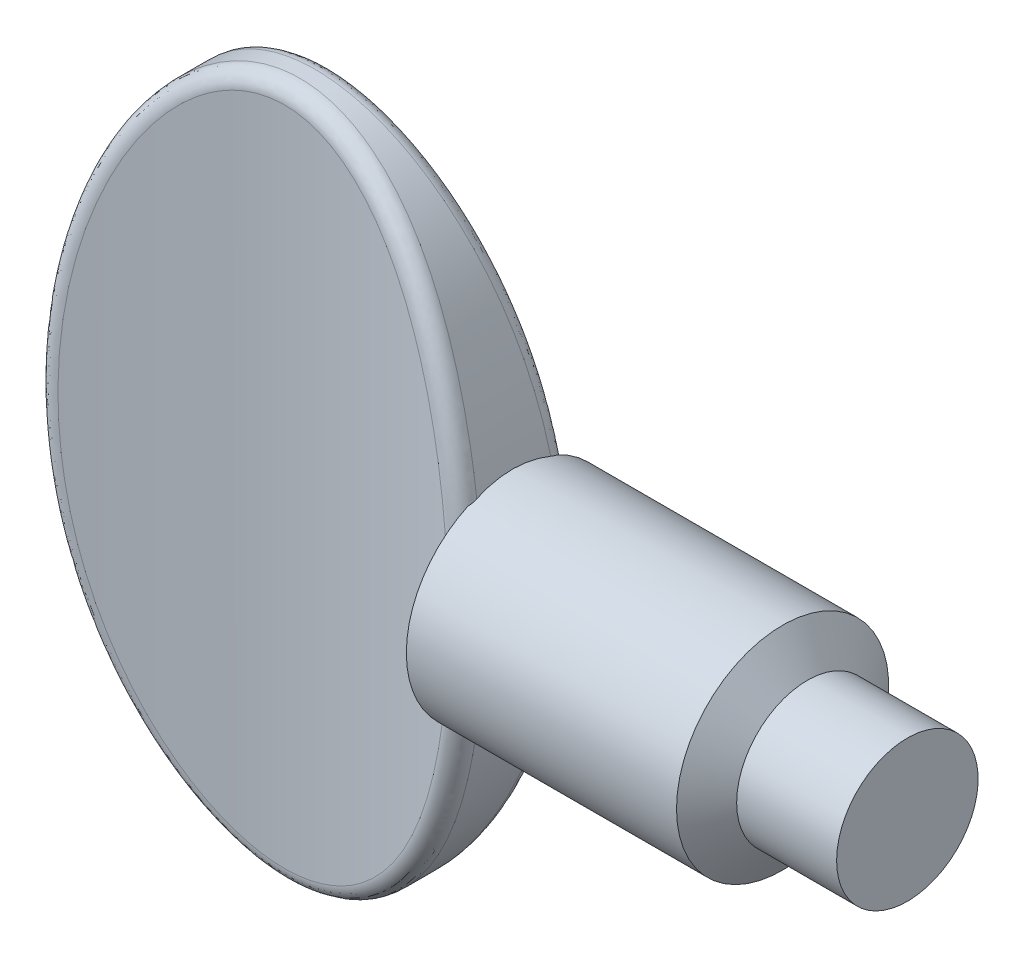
ISO-10303-21;
HEADER;
FILE_DESCRIPTION(('STEP AP214'),'2;1');
FILE_NAME('part.step','',(''),(''),'','','');
FILE_SCHEMA(('AUTOMOTIVE_DESIGN { 1 0 10303 214 1 1 1 1 }'));
ENDSEC;
DATA;
#1=APPLICATION_CONTEXT('core data for automotive mechanical design processes');
#2=APPLICATION_PROTOCOL_DEFINITION('international standard','automotive_design',2000,#1);
#3=PRODUCT_CONTEXT('',#1,'mechanical');
#4=PRODUCT('Part','Part','',(#3));
#5=PRODUCT_RELATED_PRODUCT_CATEGORY('part','',(#4));
#6=PRODUCT_DEFINITION_FORMATION('','',#4);
#7=PRODUCT_DEFINITION_CONTEXT('part definition',#1,'design');
#8=PRODUCT_DEFINITION('design','',#6,#7);
#9=PRODUCT_DEFINITION_SHAPE('','',#8);
#10=(LENGTH_UNIT() NAMED_UNIT(*) SI_UNIT(.MILLI.,.METRE.));
#11=(NAMED_UNIT(*) PLANE_ANGLE_UNIT() SI_UNIT($,.RADIAN.));
#12=(NAMED_UNIT(*) SI_UNIT($,.STERADIAN.) SOLID_ANGLE_UNIT());
#13=UNCERTAINTY_MEASURE_WITH_UNIT(LENGTH_MEASURE(1.E-05),#10,'distance_accuracy_value','');
#14=(GEOMETRIC_REPRESENTATION_CONTEXT(3) GLOBAL_UNCERTAINTY_ASSIGNED_CONTEXT((#13)) GLOBAL_UNIT_ASSIGNED_CONTEXT((#10,
#11,#12)) REPRESENTATION_CONTEXT('',''));
#15=CARTESIAN_POINT('',(0.,0.,0.));
#16=DIRECTION('',(0.,0.,1.));
#17=DIRECTION('',(1.,0.,0.));
#18=AXIS2_PLACEMENT_3D('',#15,#16,#17);
#19=CARTESIAN_POINT('',(0.,0.,1.016));
#20=DIRECTION('',(0.,0.,1.));
#21=DIRECTION('',(0.,-1.,0.));
#22=AXIS2_PLACEMENT_3D('',#19,#20,#21);
#23=ELLIPSE('',#22,5.715,3.556);
#24=DIRECTION('',(0.,0.,-1.));
#25=VECTOR('',#24,1.);
#26=SURFACE_OF_LINEAR_EXTRUSION('',#23,#25);
#27=CARTESIAN_POINT('',(3.41011531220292,-1.62014791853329,0.668376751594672));
#28=CARTESIAN_POINT('',(3.40671804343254,-1.63860905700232,0.623625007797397));
#29=CARTESIAN_POINT('',(3.40360222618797,-1.65521497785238,0.578110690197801));
#30=CARTESIAN_POINT('',(3.39801345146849,-1.68461510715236,0.485826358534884));
#31=CARTESIAN_POINT('',(3.39554052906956,-1.69740910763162,0.439056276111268));
#32=CARTESIAN_POINT('',(3.38920906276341,-1.72990576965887,0.297329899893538));
#33=CARTESIAN_POINT('',(3.38643361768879,-1.74374513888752,0.200903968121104));
#34=CARTESIAN_POINT('',(3.38412486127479,-1.75528275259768,0.00701645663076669));
#35=CARTESIAN_POINT('',(3.38459484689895,-1.75296458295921,-0.0904460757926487));
#36=CARTESIAN_POINT('',(3.38872446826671,-1.73223483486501,-0.283468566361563));
#37=CARTESIAN_POINT('',(3.39237835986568,-1.71385223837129,-0.379031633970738));
#38=CARTESIAN_POINT('',(3.39927526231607,-1.67798412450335,-0.507252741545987));
#39=CARTESIAN_POINT('',(3.40135032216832,-1.66710508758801,-0.541931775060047));
#40=CARTESIAN_POINT('',(3.40584397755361,-1.64323850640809,-0.610479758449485));
#41=CARTESIAN_POINT('',(3.4082620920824,-1.6302539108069,-0.64434976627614));
#42=CARTESIAN_POINT('',(3.41083461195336,-1.61623226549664,-0.677790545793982));
#43=B_SPLINE_CURVE_WITH_KNOTS('',3,(#27,#28,#29,#30,#31,#32,#33,#34,#35,#36,#37,#38,#39,#40,#41,
#42),.UNSPECIFIED.,.F.,.F.,(4,2,2,2,2,2,2,4),(0.,0.145499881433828,0.29100769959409,
0.581851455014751,0.872990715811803,1.16360581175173,1.2727648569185,1.381772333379),.UNSPECIFIED.);
#44=CARTESIAN_POINT('',(3.40596285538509,-1.64255427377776,0.611246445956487));
#45=VERTEX_POINT('',#44);
#46=CARTESIAN_POINT('',(3.40596285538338,-1.6425542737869,-0.611246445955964));
#47=VERTEX_POINT('',#46);
#48=EDGE_CURVE('E64',#45,#47,#43,.T.);
#49=ORIENTED_EDGE('',*,*,#48,.F.);
#50=CARTESIAN_POINT('',(2.87687361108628,2.44813994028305,0.791992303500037));
#51=CARTESIAN_POINT('',(3.18255529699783,2.5496565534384,0.881151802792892));
#52=CARTESIAN_POINT('',(3.19087427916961,2.52247577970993,0.548152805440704));
#53=CARTESIAN_POINT('',(2.94045219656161,2.23528015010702,0.810534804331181));
#54=CARTESIAN_POINT('',(3.25173180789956,2.32661822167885,0.903476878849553));
#55=CARTESIAN_POINT('',(3.25828081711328,2.30224582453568,0.567153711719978));
#56=CARTESIAN_POINT('',(2.99465455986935,2.01926969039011,0.826995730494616));
#57=CARTESIAN_POINT('',(3.31014106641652,2.10195664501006,0.923109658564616));
#58=CARTESIAN_POINT('',(3.31562682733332,2.07916028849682,0.584021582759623));
#59=CARTESIAN_POINT('',(3.08550522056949,1.5830552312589,0.85513976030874));
#60=CARTESIAN_POINT('',(3.40834569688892,1.6476446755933,0.956769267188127));
#61=CARTESIAN_POINT('',(3.41165763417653,1.62919353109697,0.61286138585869));
#62=CARTESIAN_POINT('',(3.12214641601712,1.36284957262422,0.866820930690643));
#63=CARTESIAN_POINT('',(3.4478175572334,1.41867397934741,0.970692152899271));
#64=CARTESIAN_POINT('',(3.45033488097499,1.40231081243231,0.624831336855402));
#65=CARTESIAN_POINT('',(3.17863710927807,0.919742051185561,0.885019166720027));
#66=CARTESIAN_POINT('',(3.50886358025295,0.957217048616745,0.992448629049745));
#67=CARTESIAN_POINT('',(3.50993638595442,0.946080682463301,0.643479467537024));
#68=CARTESIAN_POINT('',(3.19846897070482,0.696837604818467,0.891530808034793));
#69=CARTESIAN_POINT('',(3.53022382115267,0.725447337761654,1.00020785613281));
#70=CARTESIAN_POINT('',(3.53084199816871,0.716730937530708,0.650152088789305));
#71=CARTESIAN_POINT('',(3.22166889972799,0.250038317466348,0.89916161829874));
#72=CARTESIAN_POINT('',(3.55529121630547,0.260137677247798,1.00932947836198));
#73=CARTESIAN_POINT('',(3.55529615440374,0.257136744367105,0.657971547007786));
#74=CARTESIAN_POINT('',(3.22503654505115,0.0261434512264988,0.900280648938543));
#75=CARTESIAN_POINT('',(3.5589182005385,0.0273359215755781,1.0106627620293));
#76=CARTESIAN_POINT('',(3.55884425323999,0.0268922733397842,0.659118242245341));
#77=CARTESIAN_POINT('',(3.21529651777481,-0.424794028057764,0.897065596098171));
#78=CARTESIAN_POINT('',(3.54839475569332,-0.442282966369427,1.00681981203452));
#79=CARTESIAN_POINT('',(3.54857931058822,-0.436885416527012,0.655823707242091));
#80=CARTESIAN_POINT('',(3.20192627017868,-0.651830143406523,0.892644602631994));
#81=CARTESIAN_POINT('',(3.53399566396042,-0.678337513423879,1.00155250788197));
#82=CARTESIAN_POINT('',(3.53448957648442,-0.67041277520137,0.651293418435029));
#83=CARTESIAN_POINT('',(3.15798579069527,-1.10403389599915,0.878342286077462));
#84=CARTESIAN_POINT('',(3.48651511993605,-1.14926850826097,0.98445489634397));
#85=CARTESIAN_POINT('',(3.48815150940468,-1.13578713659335,0.636637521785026));
#86=CARTESIAN_POINT('',(3.12741141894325,-1.32920107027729,0.86845964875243));
#87=CARTESIAN_POINT('',(3.45358537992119,-1.38338047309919,0.972678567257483));
#88=CARTESIAN_POINT('',(3.45589880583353,-1.36763372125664,0.626510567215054));
#89=CARTESIAN_POINT('',(3.04849516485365,-1.77551295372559,0.843590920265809));
#90=CARTESIAN_POINT('',(3.36829281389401,-1.84818795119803,0.942941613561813));
#91=CARTESIAN_POINT('',(3.37255097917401,-1.82763853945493,0.601027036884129));
#92=CARTESIAN_POINT('',(3.00018846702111,-1.99666472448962,0.828614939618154));
#93=CARTESIAN_POINT('',(3.31625058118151,-2.07815631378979,0.925087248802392));
#94=CARTESIAN_POINT('',(3.32149316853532,-2.05580314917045,0.585680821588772));
#95=CARTESIAN_POINT('',(2.88476113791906,-2.43326023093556,0.79411239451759));
#96=CARTESIAN_POINT('',(3.19142384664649,-2.53294503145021,0.883801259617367));
#97=CARTESIAN_POINT('',(3.19926934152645,-2.50695447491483,0.550325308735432));
#98=CARTESIAN_POINT('',(2.81765268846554,-2.64870756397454,0.774588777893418));
#99=CARTESIAN_POINT('',(3.11906951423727,-2.75709243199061,0.860497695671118));
#100=CARTESIAN_POINT('',(3.12811634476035,-2.72994444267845,0.530319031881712));
#101=CARTESIAN_POINT('',(2.65311433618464,-3.0985151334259,0.729048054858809));
#102=CARTESIAN_POINT('',(2.94108253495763,-3.22556424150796,0.805967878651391));
#103=CARTESIAN_POINT('',(2.95319352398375,-3.19660978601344,0.483652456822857));
#104=CARTESIAN_POINT('',(2.55290441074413,-3.33177078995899,0.702519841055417));
#105=CARTESIAN_POINT('',(2.83297127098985,-3.46846636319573,0.774250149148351));
#106=CARTESIAN_POINT('',(2.84641629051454,-3.43928390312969,0.456468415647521));
#107=CARTESIAN_POINT('',(2.32320903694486,-3.78234312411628,0.64640489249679));
#108=CARTESIAN_POINT('',(2.58357223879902,-3.93908503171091,0.706749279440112));
#109=CARTESIAN_POINT('',(2.60051045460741,-3.91004049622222,0.398966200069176));
#110=CARTESIAN_POINT('',(2.19375678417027,-3.99967750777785,0.616821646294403));
#111=CARTESIAN_POINT('',(2.44340804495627,-4.16619911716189,0.671174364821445));
#112=CARTESIAN_POINT('',(2.4614185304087,-4.138139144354,0.368651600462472));
#113=CARTESIAN_POINT('',(1.94091533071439,-4.3535976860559,0.565411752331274));
#114=CARTESIAN_POINT('',(2.16660546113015,-4.53837771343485,0.608745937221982));
#115=CARTESIAN_POINT('',(2.18768136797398,-4.51205711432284,0.315970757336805));
#116=CARTESIAN_POINT('',(1.82542698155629,-4.49608375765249,0.543660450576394));
#117=CARTESIAN_POINT('',(2.04053515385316,-4.68812354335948,0.582339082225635));
#118=CARTESIAN_POINT('',(2.06208689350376,-4.66339853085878,0.29368172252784));
#119=CARTESIAN_POINT('',(1.57466794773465,-4.76186582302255,0.501591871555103));
#120=CARTESIAN_POINT('',(1.76506012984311,-4.96825132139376,0.530990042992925));
#121=CARTESIAN_POINT('',(1.78731476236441,-4.94761823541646,0.250573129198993));
#122=CARTESIAN_POINT('',(1.43943196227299,-4.88519470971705,0.481272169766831));
#123=CARTESIAN_POINT('',(1.61619495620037,-5.09885836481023,0.506044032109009));
#124=CARTESIAN_POINT('',(1.63817843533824,-5.08052812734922,0.229751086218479));
#125=CARTESIAN_POINT('',(1.1911972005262,-5.07171066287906,0.449763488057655));
#126=CARTESIAN_POINT('',(1.340429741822,-5.29730303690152,0.467084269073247));
#127=CARTESIAN_POINT('',(1.36169787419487,-5.28324603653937,0.197463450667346));
#128=CARTESIAN_POINT('',(1.08336860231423,-5.14191532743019,0.437647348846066));
#129=CARTESIAN_POINT('',(1.22051144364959,-5.3722217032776,0.452038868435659));
#130=CARTESIAN_POINT('',(1.24085897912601,-5.36011289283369,0.185047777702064));
#131=CARTESIAN_POINT('',(0.858050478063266,-5.26424468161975,0.416270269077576));
#132=CARTESIAN_POINT('',(0.968834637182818,-5.50292549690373,0.42542157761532));
#133=CARTESIAN_POINT('',(0.986440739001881,-5.49490642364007,0.163142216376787));
#134=CARTESIAN_POINT('',(0.740575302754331,-5.31639564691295,0.407005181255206));
#135=CARTESIAN_POINT('',(0.836995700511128,-5.5590377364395,0.413787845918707));
#136=CARTESIAN_POINT('',(0.85288027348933,-5.55286061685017,0.153648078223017));
#137=CARTESIAN_POINT('',(0.515993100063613,-5.39221579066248,0.393443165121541));
#138=CARTESIAN_POINT('',(0.584104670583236,-5.64060692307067,0.396743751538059));
#139=CARTESIAN_POINT('',(0.595858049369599,-5.63753360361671,0.139750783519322));
#140=CARTESIAN_POINT('',(0.409913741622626,-5.41895204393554,0.38861490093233));
#141=CARTESIAN_POINT('',(0.464186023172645,-5.66954672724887,0.390631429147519));
#142=CARTESIAN_POINT('',(0.473813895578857,-5.66759942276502,0.134803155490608));
#143=CARTESIAN_POINT('',(0.194791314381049,-5.45394261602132,0.382284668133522));
#144=CARTESIAN_POINT('',(0.220889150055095,-5.70732589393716,0.382635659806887));
#145=CARTESIAN_POINT('',(0.225513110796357,-5.70700859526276,0.128316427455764));
#146=CARTESIAN_POINT('',(0.0857502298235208,-5.46220901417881,0.380780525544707));
#147=CARTESIAN_POINT('',(0.0971189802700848,-5.71630681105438,0.380722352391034));
#148=CARTESIAN_POINT('',(0.0992592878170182,-5.71636549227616,0.126775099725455));
#149=CARTESIAN_POINT('',(-0.132181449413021,-5.45950203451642,0.381271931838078));
#150=CARTESIAN_POINT('',(-0.149751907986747,-5.71338033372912,0.381344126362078));
#151=CARTESIAN_POINT('',(-0.15300824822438,-5.71330808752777,0.127278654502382));
#152=CARTESIAN_POINT('',(-0.24107184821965,-5.44851292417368,0.383270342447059));
#153=CARTESIAN_POINT('',(-0.27330895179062,-5.70144504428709,0.383885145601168));
#154=CARTESIAN_POINT('',(-0.27902168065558,-5.70087598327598,0.129326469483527));
#155=CARTESIAN_POINT('',(-0.455477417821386,-5.40829096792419,0.390538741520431));
#156=CARTESIAN_POINT('',(-0.515669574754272,-5.65803605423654,0.393060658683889));
#157=CARTESIAN_POINT('',(-0.526267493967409,-5.65561592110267,0.136774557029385));
#158=CARTESIAN_POINT('',(-0.560990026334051,-5.37904460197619,0.395811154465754));
#159=CARTESIAN_POINT('',(-0.634846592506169,-5.62640367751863,0.399728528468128));
#160=CARTESIAN_POINT('',(-0.647496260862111,-5.62277284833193,0.142177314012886));
#161=CARTESIAN_POINT('',(-0.791362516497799,-5.29549090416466,0.410722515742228));
#162=CARTESIAN_POINT('',(-0.894095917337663,-5.53655861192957,0.418454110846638));
#163=CARTESIAN_POINT('',(-0.910741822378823,-5.52960626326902,0.157457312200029));
#164=CARTESIAN_POINT('',(-0.914651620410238,-5.23680665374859,0.421113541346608));
#165=CARTESIAN_POINT('',(-1.03227791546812,-5.4734725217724,0.431484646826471));
#166=CARTESIAN_POINT('',(-1.05060182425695,-5.46452941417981,0.168105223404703));
#167=CARTESIAN_POINT('',(-1.1501410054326,-5.1000145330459,0.444888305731));
#168=CARTESIAN_POINT('',(-1.29493907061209,-5.32749236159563,0.461037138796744));
#169=CARTESIAN_POINT('',(-1.31582055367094,-5.31418719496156,0.192467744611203));
#170=CARTESIAN_POINT('',(-1.26232097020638,-5.02187196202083,0.458277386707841));
#171=CARTESIAN_POINT('',(-1.41945940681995,-5.24422211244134,0.477628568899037));
#172=CARTESIAN_POINT('',(-1.44115278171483,-5.22888577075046,0.20618782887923));
#173=CARTESIAN_POINT('',(-1.52425358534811,-4.81141848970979,0.493480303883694));
#174=CARTESIAN_POINT('',(-1.71006807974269,-5.02053132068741,0.521084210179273));
#175=CARTESIAN_POINT('',(-1.73197783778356,-5.00086686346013,0.242261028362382));
#176=CARTESIAN_POINT('',(-1.66743267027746,-4.67075761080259,0.516329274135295));
#177=CARTESIAN_POINT('',(-1.86727379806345,-4.87182691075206,0.549058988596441));
#178=CARTESIAN_POINT('',(-1.88928718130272,-4.84982635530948,0.265674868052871));
#179=CARTESIAN_POINT('',(-1.93076565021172,-4.36861808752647,0.56315778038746));
#180=CARTESIAN_POINT('',(-2.15601250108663,-4.55386893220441,0.606083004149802));
#181=CARTESIAN_POINT('',(-2.17678970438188,-4.52789876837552,0.313661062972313));
#182=CARTESIAN_POINT('',(-2.05086652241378,-4.20709289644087,0.587139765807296));
#183=CARTESIAN_POINT('',(-2.28680032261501,-4.38442619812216,0.63511216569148));
#184=CARTESIAN_POINT('',(-2.30692049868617,-4.35696740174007,0.338235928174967));
#185=CARTESIAN_POINT('',(-2.24774440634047,-3.90468381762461,0.629494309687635));
#186=CARTESIAN_POINT('',(-2.50094051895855,-4.06830128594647,0.686196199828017));
#187=CARTESIAN_POINT('',(-2.51931723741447,-4.03858337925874,0.38163755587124));
#188=CARTESIAN_POINT('',(-2.32835126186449,-3.7663893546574,0.648005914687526));
#189=CARTESIAN_POINT('',(-2.58844569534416,-3.92375543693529,0.708482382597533));
#190=CARTESIAN_POINT('',(-2.60592272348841,-3.89353451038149,0.400606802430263));
#191=CARTESIAN_POINT('',(-2.47764655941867,-3.48301662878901,0.68392178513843));
#192=CARTESIAN_POINT('',(-2.750598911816,-3.62773016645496,0.751698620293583));
#193=CARTESIAN_POINT('',(-2.76590357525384,-3.59720408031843,0.437410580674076));
#194=CARTESIAN_POINT('',(-2.54632812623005,-3.33793451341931,0.701325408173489));
#195=CARTESIAN_POINT('',(-2.82495665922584,-3.4763903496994,0.772577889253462));
#196=CARTESIAN_POINT('',(-2.83927131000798,-3.44591898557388,0.455244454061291));
#197=CARTESIAN_POINT('',(-2.73596214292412,-2.89487609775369,0.751105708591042));
#198=CARTESIAN_POINT('',(-3.03164049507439,-3.01174573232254,0.832642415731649));
#199=CARTESIAN_POINT('',(-3.04146428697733,-2.98492820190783,0.506255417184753));
#200=CARTESIAN_POINT('',(-2.84046694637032,-2.58914736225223,0.781043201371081));
#201=CARTESIAN_POINT('',(-3.1439027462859,-2.69404108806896,0.868280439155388));
#202=CARTESIAN_POINT('',(-3.15233965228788,-2.66814963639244,0.53693302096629));
#203=CARTESIAN_POINT('',(-3.02361670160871,-1.91917408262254,0.835455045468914));
#204=CARTESIAN_POINT('',(-3.34221273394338,-1.99525212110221,0.933484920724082));
#205=CARTESIAN_POINT('',(-3.34632626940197,-1.97562309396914,0.592690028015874));
#206=CARTESIAN_POINT('',(-3.09598835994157,-1.55305613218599,0.858425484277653));
#207=CARTESIAN_POINT('',(-3.41971506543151,-1.61558535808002,0.960711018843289));
#208=CARTESIAN_POINT('',(-3.42273238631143,-1.59818444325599,0.616228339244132));
#209=CARTESIAN_POINT('',(-3.19389380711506,-0.813438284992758,0.889906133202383));
#210=CARTESIAN_POINT('',(-3.52551559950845,-0.845326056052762,0.998352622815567));
#211=CARTESIAN_POINT('',(-3.52603668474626,-0.836598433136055,0.648487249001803));
#212=CARTESIAN_POINT('',(-3.219394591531,-0.439933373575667,0.898406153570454));
#213=CARTESIAN_POINT('',(-3.55284253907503,-0.458062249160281,1.00842962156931));
#214=CARTESIAN_POINT('',(-3.55289998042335,-0.452446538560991,0.657197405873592));
#215=CARTESIAN_POINT('',(-3.22377462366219,0.165515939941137,0.899871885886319));
#216=CARTESIAN_POINT('',(-3.55753925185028,0.172415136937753,1.01016840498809));
#217=CARTESIAN_POINT('',(-3.55751322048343,0.170223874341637,0.658699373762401));
#218=CARTESIAN_POINT('',(-3.21666132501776,0.397456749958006,0.897504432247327));
#219=CARTESIAN_POINT('',(-3.54988979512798,0.413553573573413,1.00735185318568));
#220=CARTESIAN_POINT('',(-3.55001934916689,0.408752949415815,0.656273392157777));
#221=CARTESIAN_POINT('',(-3.18467556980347,0.860036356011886,0.887014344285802));
#222=CARTESIAN_POINT('',(-3.51533559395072,0.895293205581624,0.994814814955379));
#223=CARTESIAN_POINT('',(-3.5162998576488,0.884649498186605,0.645523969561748));
#224=CARTESIAN_POINT('',(-3.15979714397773,1.09067468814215,0.878889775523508));
#225=CARTESIAN_POINT('',(-3.48854259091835,1.1350753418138,0.9851346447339));
#226=CARTESIAN_POINT('',(-3.49006794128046,1.12201655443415,0.637198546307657));
#227=CARTESIAN_POINT('',(-3.09177046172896,1.54865418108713,0.857163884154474));
#228=CARTESIAN_POINT('',(-3.41502593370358,1.61202494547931,0.959158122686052));
#229=CARTESIAN_POINT('',(-3.41826670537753,1.59374884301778,0.614935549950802));
#230=CARTESIAN_POINT('',(-3.04863796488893,1.77599801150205,0.843567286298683));
#231=CARTESIAN_POINT('',(-3.36857207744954,1.84840189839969,0.942954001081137));
#232=CARTESIAN_POINT('',(-3.37271406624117,1.82811648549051,0.601002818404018));
#233=CARTESIAN_POINT('',(-2.94317111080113,2.22543485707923,0.811418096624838));
#234=CARTESIAN_POINT('',(-3.25454291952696,2.31651004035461,0.904496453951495));
#235=CARTESIAN_POINT('',(-3.26114490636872,2.29208476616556,0.568058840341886));
#236=CARTESIAN_POINT('',(-2.88084877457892,2.44753106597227,0.792868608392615));
#237=CARTESIAN_POINT('',(-3.18737593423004,2.54750357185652,0.882369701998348));
#238=CARTESIAN_POINT('',(-3.1951411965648,2.52168829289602,0.549050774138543));
#239=CARTESIAN_POINT('',(-2.72296807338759,2.92171701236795,0.747996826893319));
#240=CARTESIAN_POINT('',(-3.01671846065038,3.04112688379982,0.828682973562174));
#241=CARTESIAN_POINT('',(-3.02753524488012,3.01295829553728,0.503069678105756));
#242=CARTESIAN_POINT('',(-2.62354531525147,3.17242818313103,0.720887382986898));
#243=CARTESIAN_POINT('',(-2.9095837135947,3.3020505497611,0.796309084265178));
#244=CARTESIAN_POINT('',(-2.92177195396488,3.27338041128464,0.475290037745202));
#245=CARTESIAN_POINT('',(-2.45047373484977,3.53592668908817,0.677330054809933));
#246=CARTESIAN_POINT('',(-2.72089131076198,3.68328686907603,0.743720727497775));
#247=CARTESIAN_POINT('',(-2.73679732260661,3.65249750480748,0.430655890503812));
#248=CARTESIAN_POINT('',(-2.38881716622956,3.6549621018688,0.662334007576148));
#249=CARTESIAN_POINT('',(-2.65403373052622,3.80757139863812,0.725698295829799));
#250=CARTESIAN_POINT('',(-2.6707761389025,3.77691258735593,0.415289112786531));
#251=CARTESIAN_POINT('',(-2.25689122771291,3.88780573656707,0.631713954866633));
#252=CARTESIAN_POINT('',(-2.51060863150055,4.0509787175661,0.688809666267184));
#253=CARTESIAN_POINT('',(-2.52910566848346,4.02092289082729,0.383912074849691));
#254=CARTESIAN_POINT('',(-2.18662455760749,4.00161558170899,0.616090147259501));
#255=CARTESIAN_POINT('',(-2.43421779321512,4.17003284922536,0.669971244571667));
#256=CARTESIAN_POINT('',(-2.45345939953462,4.14051960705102,0.367902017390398));
#257=CARTESIAN_POINT('',(-2.00630311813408,4.26762511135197,0.578214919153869));
#258=CARTESIAN_POINT('',(-2.23805461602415,4.4481030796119,0.624273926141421));
#259=CARTESIAN_POINT('',(-2.25863520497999,4.42099703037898,0.329090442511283));
#260=CARTESIAN_POINT('',(-1.89168515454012,4.4166251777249,0.555850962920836));
#261=CARTESIAN_POINT('',(-2.11309442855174,4.60451461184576,0.597170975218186));
#262=CARTESIAN_POINT('',(-2.1342612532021,4.57889839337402,0.306173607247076));
#263=CARTESIAN_POINT('',(-1.64204982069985,4.69578543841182,0.512276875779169));
#264=CARTESIAN_POINT('',(-1.83921681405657,4.89842163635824,0.544072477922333));
#265=CARTESIAN_POINT('',(-1.86139526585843,4.87668575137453,0.261522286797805));
#266=CARTESIAN_POINT('',(-1.50706569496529,4.82597567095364,0.491064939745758));
#267=CARTESIAN_POINT('',(-1.69088789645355,5.03609559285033,0.518086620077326));
#268=CARTESIAN_POINT('',(-1.71294250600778,5.01660042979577,0.239785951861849));
#269=CARTESIAN_POINT('',(-1.25822257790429,5.02460380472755,0.457805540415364));
#270=CARTESIAN_POINT('',(-1.41485811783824,5.24717231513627,0.477035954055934));
#271=CARTESIAN_POINT('',(-1.43656618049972,5.23187493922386,0.205704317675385));
#272=CARTESIAN_POINT('',(-1.14977220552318,5.09995591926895,0.444894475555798));
#273=CARTESIAN_POINT('',(-1.29446557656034,5.32746078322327,0.461038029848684));
#274=CARTESIAN_POINT('',(-1.3153835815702,5.31413478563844,0.192474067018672));
#275=CARTESIAN_POINT('',(-0.922470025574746,5.23252776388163,0.421861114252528));
#276=CARTESIAN_POINT('',(-1.04096461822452,5.4689251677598,0.432410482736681));
#277=CARTESIAN_POINT('',(-1.0594278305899,5.45981518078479,0.16887127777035));
#278=CARTESIAN_POINT('',(-0.80363402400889,5.28977445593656,0.41173467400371));
#279=CARTESIAN_POINT('',(-0.907817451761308,5.53043531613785,0.419719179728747));
#280=CARTESIAN_POINT('',(-0.924675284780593,5.5232637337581,0.158494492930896));
#281=CARTESIAN_POINT('',(-0.577455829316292,5.37398354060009,0.39672020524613));
#282=CARTESIAN_POINT('',(-0.653408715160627,5.62094693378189,0.40087394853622));
#283=CARTESIAN_POINT('',(-0.666376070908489,5.6171058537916,0.143108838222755));
#284=CARTESIAN_POINT('',(-0.471370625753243,5.4043497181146,0.391249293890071));
#285=CARTESIAN_POINT('',(-0.5336224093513,5.65378212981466,0.393957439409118));
#286=CARTESIAN_POINT('',(-0.544550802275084,5.65118930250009,0.13750267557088));
#287=CARTESIAN_POINT('',(-0.255633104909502,5.44661210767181,0.38361532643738));
#288=CARTESIAN_POINT('',(-0.289803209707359,5.69938537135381,0.384322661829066));
#289=CARTESIAN_POINT('',(-0.295851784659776,5.69872932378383,0.129679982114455));
#290=CARTESIAN_POINT('',(-0.145983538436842,5.45852223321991,0.38144977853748));
#291=CARTESIAN_POINT('',(-0.165395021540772,5.71232072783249,0.381569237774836));
#292=CARTESIAN_POINT('',(-0.168981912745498,5.71220143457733,0.127460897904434));
#293=CARTESIAN_POINT('',(0.0738869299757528,5.46278107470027,0.380676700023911));
#294=CARTESIAN_POINT('',(0.0836678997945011,5.7169249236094,0.380591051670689));
#295=CARTESIAN_POINT('',(0.0855232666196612,5.71701154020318,0.126668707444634));
#296=CARTESIAN_POINT('',(0.184108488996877,5.45509623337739,0.382075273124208));
#297=CARTESIAN_POINT('',(0.208792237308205,5.70857455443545,0.382370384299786));
#298=CARTESIAN_POINT('',(0.21315951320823,5.70831156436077,0.128101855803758));
#299=CARTESIAN_POINT('',(0.401619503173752,5.42083768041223,0.38827437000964));
#300=CARTESIAN_POINT('',(0.454815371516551,5.67158273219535,0.390201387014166));
#301=CARTESIAN_POINT('',(0.464261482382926,5.66972014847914,0.134454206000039));
#302=CARTESIAN_POINT('',(0.50890688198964,5.3942509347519,0.393077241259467));
#303=CARTESIAN_POINT('',(0.576122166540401,5.64279808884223,0.39628327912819));
#304=CARTESIAN_POINT('',(0.587724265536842,5.63981408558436,0.13937581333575));
#305=CARTESIAN_POINT('',(0.739415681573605,5.31719606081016,0.40686416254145));
#306=CARTESIAN_POINT('',(0.83573942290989,5.55988553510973,0.41361366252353));
#307=CARTESIAN_POINT('',(0.851580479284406,5.55374603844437,0.153503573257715));
#308=CARTESIAN_POINT('',(0.861383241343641,5.26294420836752,0.416504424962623));
#309=CARTESIAN_POINT('',(0.972626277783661,5.50149772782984,0.425721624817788));
#310=CARTESIAN_POINT('',(0.990242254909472,5.49345262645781,0.163382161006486));
#311=CARTESIAN_POINT('',(1.0949077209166,5.13510542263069,0.438830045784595));
#312=CARTESIAN_POINT('',(1.23342883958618,5.36492676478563,0.453514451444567));
#313=CARTESIAN_POINT('',(1.2538468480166,5.35263149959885,0.186259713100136));
#314=CARTESIAN_POINT('',(1.20644657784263,5.06148575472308,0.451520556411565));
#315=CARTESIAN_POINT('',(1.35742533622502,5.28637625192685,0.469268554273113));
#316=CARTESIAN_POINT('',(1.37876592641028,5.2720695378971,0.199263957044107));
#317=CARTESIAN_POINT('',(1.46573802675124,4.86335533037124,0.484912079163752));
#318=CARTESIAN_POINT('',(1.64542638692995,5.0755944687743,0.510545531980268));
#319=CARTESIAN_POINT('',(1.66733639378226,5.05689690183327,0.233480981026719));
#320=CARTESIAN_POINT('',(1.60745261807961,4.73079185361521,0.506661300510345));
#321=CARTESIAN_POINT('',(1.80127145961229,4.93527393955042,0.537224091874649));
#322=CARTESIAN_POINT('',(1.82341116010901,4.914206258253,0.255767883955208));
#323=CARTESIAN_POINT('',(1.86900175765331,4.44495554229,0.551550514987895));
#324=CARTESIAN_POINT('',(2.08839377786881,4.63419132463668,0.591965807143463));
#325=CARTESIAN_POINT('',(2.10960205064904,4.60897313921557,0.301766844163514));
#326=CARTESIAN_POINT('',(1.98878809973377,4.29163833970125,0.574693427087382));
#327=CARTESIAN_POINT('',(2.21900804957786,4.47319746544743,0.620024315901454));
#328=CARTESIAN_POINT('',(2.23966103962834,4.44638820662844,0.32548189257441));
#329=CARTESIAN_POINT('',(2.18584389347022,4.00402857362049,0.615817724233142));
#330=CARTESIAN_POINT('',(2.43354527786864,4.17232015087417,0.669684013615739));
#331=CARTESIAN_POINT('',(2.45265033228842,4.14301394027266,0.367622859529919));
#332=CARTESIAN_POINT('',(2.26678612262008,3.87233883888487,0.633878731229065));
#333=CARTESIAN_POINT('',(2.52149542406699,4.03457978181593,0.691453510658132));
#334=CARTESIAN_POINT('',(2.5397676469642,4.00465027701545,0.386130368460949));
#335=CARTESIAN_POINT('',(2.4172945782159,3.60212171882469,0.669113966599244));
#336=CARTESIAN_POINT('',(2.68508948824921,3.75215155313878,0.733890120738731));
#337=CARTESIAN_POINT('',(2.70131013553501,3.72162071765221,0.422236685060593));
#338=CARTESIAN_POINT('',(2.48685442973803,3.463590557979,0.686287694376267));
#339=CARTESIAN_POINT('',(2.76046142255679,3.60757416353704,0.754513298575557));
#340=CARTESIAN_POINT('',(2.77572819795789,3.57695134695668,0.439834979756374));
#341=CARTESIAN_POINT('',(2.61551558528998,3.18118784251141,0.71926816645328));
#342=CARTESIAN_POINT('',(2.89998706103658,3.31289252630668,0.794118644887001));
#343=CARTESIAN_POINT('',(2.91309166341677,3.28272006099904,0.473630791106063));
#344=CARTESIAN_POINT('',(2.6746042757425,3.03731009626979,0.73507325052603));
#345=CARTESIAN_POINT('',(2.96389868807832,3.16294480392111,0.813050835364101));
#346=CARTESIAN_POINT('',(2.97602323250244,3.13315249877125,0.489826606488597));
#347=CARTESIAN_POINT('',(2.78296275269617,2.74552013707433,0.764925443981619));
#348=CARTESIAN_POINT('',(3.08122852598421,2.85877616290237,0.84882953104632));
#349=CARTESIAN_POINT('',(3.09125015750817,2.83035190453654,0.520416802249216));
#350=CARTESIAN_POINT('',(2.83222971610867,2.59760677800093,0.778972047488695));
#351=CARTESIAN_POINT('',(3.13445317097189,2.70474702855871,0.865627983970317));
#352=CARTESIAN_POINT('',(3.14354245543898,2.67711783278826,0.534810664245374));
#353=CARTESIAN_POINT('',(2.87687361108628,2.44813994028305,0.791992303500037));
#354=CARTESIAN_POINT('',(3.18255529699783,2.5496565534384,0.881151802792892));
#355=CARTESIAN_POINT('',(3.19087427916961,2.52247577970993,0.548152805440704));
#356=(BOUNDED_SURFACE() B_SPLINE_SURFACE(3,2,((#50,#51,#52),(#53,#54,#55),(#56,#57,#58),(#59,
#60,#61),(#62,#63,#64),(#65,#66,#67),(#68,#69,#70),(#71,#72,#73),(#74,#75,#76),(#77,#78,#79),
(#80,#81,#82),(#83,#84,#85),(#86,#87,#88),(#89,#90,#91),(#92,#93,#94),(#95,#96,#97),(#98,#99,
#100),(#101,#102,#103),(#104,#105,#106),(#107,#108,#109),(#110,#111,#112),(#113,#114,#115),
(#116,#117,#118),(#119,#120,#121),(#122,#123,#124),(#125,#126,#127),(#128,#129,#130),(#131,#132,
#133),(#134,#135,#136),(#137,#138,#139),(#140,#141,#142),(#143,#144,#145),(#146,#147,#148),
(#149,#150,#151),(#152,#153,#154),(#155,#156,#157),(#158,#159,#160),(#161,#162,#163),(#164,#165,
#166),(#167,#168,#169),(#170,#171,#172),(#173,#174,#175),(#176,#177,#178),(#179,#180,#181),
(#182,#183,#184),(#185,#186,#187),(#188,#189,#190),(#191,#192,#193),(#194,#195,#196),(#197,#198,
#199),(#200,#201,#202),(#203,#204,#205),(#206,#207,#208),(#209,#210,#211),(#212,#213,#214),
(#215,#216,#217),(#218,#219,#220),(#221,#222,#223),(#224,#225,#226),(#227,#228,#229),(#230,#231,
#232),(#233,#234,#235),(#236,#237,#238),(#239,#240,#241),(#242,#243,#244),(#245,#246,#247),
(#248,#249,#250),(#251,#252,#253),(#254,#255,#256),(#257,#258,#259),(#260,#261,#262),(#263,#264,
#265),(#266,#267,#268),(#269,#270,#271),(#272,#273,#274),(#275,#276,#277),(#278,#279,#280),
(#281,#282,#283),(#284,#285,#286),(#287,#288,#289),(#290,#291,#292),(#293,#294,#295),(#296,#297,
#298),(#299,#300,#301),(#302,#303,#304),(#305,#306,#307),(#308,#309,#310),(#311,#312,#313),
(#314,#315,#316),(#317,#318,#319),(#320,#321,#322),(#323,#324,#325),(#326,#327,#328),(#329,#330,
#331),(#332,#333,#334),(#335,#336,#337),(#338,#339,#340),(#341,#342,#343),(#344,#345,#346),
(#347,#348,#349),(#350,#351,#352),(#353,#354,#355)),.UNSPECIFIED.,.T.,.F.,
.F.) B_SPLINE_SURFACE_WITH_KNOTS((4,2,2,2,2,2,2,2,2,2,2,2,2,2,2,2,2,2,2,2,2,2,2,2,2,2,2,2,2,2,2,
2,2,2,2,2,2,2,2,2,2,2,2,2,2,2,2,2,2,2,4),(3,3),(0.,0.670088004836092,1.34044677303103,
2.01150801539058,2.68258646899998,3.36432560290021,4.04622885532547,4.72678632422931,
5.40690386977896,6.17399274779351,6.94021517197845,7.49835151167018,8.05551867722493,
8.44869733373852,8.84130132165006,9.17597761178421,9.51043495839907,9.8451656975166,
10.1801446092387,10.5969595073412,11.0145231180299,11.6249253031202,12.2367135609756,
12.7226461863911,13.2088580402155,14.1814928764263,15.3007522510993,16.4207994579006,
17.116313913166,17.8120621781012,18.5072109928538,19.2019252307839,20.0156340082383,
20.4222285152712,20.8286958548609,21.4003838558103,21.9711485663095,22.3745805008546,
22.7774087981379,23.1149751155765,23.4522868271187,23.7901765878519,24.1282995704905,
24.5358772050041,24.9441481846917,25.5345239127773,26.1261823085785,26.5957484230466,
27.0655766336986,27.5359670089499,28.0064923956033),(0.,1.),
.UNSPECIFIED.) GEOMETRIC_REPRESENTATION_ITEM() RATIONAL_B_SPLINE_SURFACE(((1.,0.605083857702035,
1.),(1.,0.601611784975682,1.),(1.,0.5986115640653,1.),(1.,0.59355041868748,1.),(1.,
0.591489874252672,1.),(1.,0.588302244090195,1.),(1.,0.587176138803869,1.),(1.,0.585858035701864,
1.),(1.,0.585666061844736,1.),(1.,0.586220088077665,1.),(1.,0.586981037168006,1.),(1.,
0.589468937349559,1.),(1.,0.591196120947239,1.),(1.,0.59561711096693,1.),(1.,0.598309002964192,
1.),(1.,0.60466419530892,1.),(1.,0.6083268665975,1.),(1.,0.617156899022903,1.),(1.,
0.622456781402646,1.),(1.,0.634262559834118,1.),(1.,0.640767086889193,1.),(1.,0.652862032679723,
1.),(1.,0.658220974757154,1.),(1.,0.669205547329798,1.),(1.,0.674830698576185,1.),(1.,
0.684105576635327,1.),(1.,0.687849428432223,1.),(1.,0.69472599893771,1.),(1.,0.697859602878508,
1.),(1.,0.702576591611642,1.),(1.,0.704320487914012,1.),(1.,0.70662574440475,1.),(1.,
0.707187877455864,1.),(1.,0.707006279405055,1.),(1.,0.706261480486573,1.),(1.,0.70362723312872,
1.),(1.,0.701736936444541,1.),(1.,0.696594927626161,1.),(1.,0.693123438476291,1.),(1.,
0.685596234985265,1.),(1.,0.681539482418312,1.),(1.,0.671400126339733,1.),(1.,0.665247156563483,
1.),(1.,0.653377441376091,1.),(1.,0.647661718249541,1.),(1.,0.638021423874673,1.),(1.,
0.633970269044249,1.),(1.,0.626341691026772,1.),(1.,0.622764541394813,1.),(1.,0.612770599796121,
1.),(1.,0.607093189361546,1.),(1.,0.597028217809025,1.),(1.,0.592964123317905,1.),(1.,
0.587442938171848,1.),(1.,0.585987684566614,1.),(1.,0.585737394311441,1.),(1.,0.586143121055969,
1.),(1.,0.587958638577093,1.),(1.,0.589368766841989,1.),(1.,0.593196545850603,1.),(1.,
0.595613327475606,1.),(1.,0.601457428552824,1.),(1.,0.604884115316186,1.),(1.,0.613433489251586,
1.),(1.,0.618746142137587,1.),(1.,0.627733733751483,1.),(1.,0.630898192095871,1.),(1.,
0.6375502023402,1.),(1.,0.641037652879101,1.),(1.,0.649782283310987,1.),(1.,0.655182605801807,
1.),(1.,0.666333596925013,1.),(1.,0.672083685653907,1.),(1.,0.681684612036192,1.),(1.,
0.685598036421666,1.),(1.,0.692883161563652,1.),(1.,0.69625566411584,1.),(1.,0.701416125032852,
1.),(1.,0.703372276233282,1.),(1.,0.706134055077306,1.),(1.,0.706940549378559,1.),(1.,
0.707226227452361,1.),(1.,0.70670313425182,1.),(1.,0.704443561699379,1.),(1.,0.702706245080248,
1.),(1.,0.69790604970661,1.),(1.,0.694644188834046,1.),(1.,0.687475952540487,1.),(1.,
0.683568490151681,1.),(1.,0.673792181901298,1.),(1.,0.667825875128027,1.),(1.,0.65623775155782,
1.),(1.,0.650616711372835,1.),(1.,0.64108568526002,1.),(1.,0.637061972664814,1.),(1.,
0.629448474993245,1.),(1.,0.625858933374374,1.),(1.,0.619133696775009,1.),(1.,0.615998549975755,
1.),(1.,0.610192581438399,1.),(1.,0.607521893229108,1.),(1.,0.605083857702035,1.))) REPRESENTATION_ITEM('') SURFACE());
#357=CARTESIAN_POINT('',(3.19087427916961,2.52247577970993,0.548152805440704));
#358=CARTESIAN_POINT('',(3.25828081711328,2.30224582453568,0.567153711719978));
#359=CARTESIAN_POINT('',(3.31562682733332,2.07916028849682,0.584021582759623));
#360=CARTESIAN_POINT('',(3.41165763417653,1.62919353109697,0.61286138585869));
#361=CARTESIAN_POINT('',(3.45033488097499,1.40231081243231,0.624831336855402));
#362=CARTESIAN_POINT('',(3.50993638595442,0.946080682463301,0.643479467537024));
#363=CARTESIAN_POINT('',(3.5308419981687,0.716730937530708,0.650152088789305));
#364=CARTESIAN_POINT('',(3.55529615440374,0.257136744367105,0.657971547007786));
#365=CARTESIAN_POINT('',(3.55884425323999,0.0268922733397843,0.659118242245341));
#366=CARTESIAN_POINT('',(3.54857931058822,-0.436885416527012,0.655823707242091));
#367=CARTESIAN_POINT('',(3.53448957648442,-0.67041277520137,0.651293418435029));
#368=CARTESIAN_POINT('',(3.48815150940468,-1.13578713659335,0.636637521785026));
#369=CARTESIAN_POINT('',(3.45589880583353,-1.36763372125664,0.626510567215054));
#370=CARTESIAN_POINT('',(3.37255097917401,-1.82763853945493,0.601027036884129));
#371=CARTESIAN_POINT('',(3.32149316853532,-2.05580314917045,0.585680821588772));
#372=CARTESIAN_POINT('',(3.19926934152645,-2.50695447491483,0.550325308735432));
#373=CARTESIAN_POINT('',(3.12811634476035,-2.72994444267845,0.530319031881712));
#374=CARTESIAN_POINT('',(2.95319352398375,-3.19660978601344,0.483652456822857));
#375=CARTESIAN_POINT('',(2.84641629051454,-3.43928390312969,0.456468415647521));
#376=CARTESIAN_POINT('',(2.60051045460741,-3.91004049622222,0.398966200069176));
#377=CARTESIAN_POINT('',(2.4614185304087,-4.138139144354,0.368651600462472));
#378=CARTESIAN_POINT('',(2.18768136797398,-4.51205711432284,0.315970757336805));
#379=CARTESIAN_POINT('',(2.06208689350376,-4.66339853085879,0.29368172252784));
#380=CARTESIAN_POINT('',(1.78731476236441,-4.94761823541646,0.250573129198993));
#381=CARTESIAN_POINT('',(1.63817843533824,-5.08052812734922,0.229751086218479));
#382=CARTESIAN_POINT('',(1.36169787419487,-5.28324603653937,0.197463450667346));
#383=CARTESIAN_POINT('',(1.24085897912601,-5.36011289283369,0.185047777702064));
#384=CARTESIAN_POINT('',(0.986440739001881,-5.49490642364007,0.163142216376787));
#385=CARTESIAN_POINT('',(0.852880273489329,-5.55286061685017,0.153648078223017));
#386=CARTESIAN_POINT('',(0.595858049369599,-5.63753360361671,0.139750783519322));
#387=CARTESIAN_POINT('',(0.473813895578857,-5.66759942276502,0.134803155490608));
#388=CARTESIAN_POINT('',(0.225513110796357,-5.70700859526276,0.128316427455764));
#389=CARTESIAN_POINT('',(0.0992592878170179,-5.71636549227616,0.126775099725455));
#390=CARTESIAN_POINT('',(-0.15300824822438,-5.71330808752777,0.127278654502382));
#391=CARTESIAN_POINT('',(-0.279021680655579,-5.70087598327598,0.129326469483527));
#392=CARTESIAN_POINT('',(-0.526267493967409,-5.65561592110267,0.136774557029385));
#393=CARTESIAN_POINT('',(-0.647496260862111,-5.62277284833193,0.142177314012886));
#394=CARTESIAN_POINT('',(-0.910741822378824,-5.52960626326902,0.157457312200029));
#395=CARTESIAN_POINT('',(-1.05060182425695,-5.46452941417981,0.168105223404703));
#396=CARTESIAN_POINT('',(-1.31582055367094,-5.31418719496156,0.192467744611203));
#397=CARTESIAN_POINT('',(-1.44115278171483,-5.22888577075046,0.20618782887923));
#398=CARTESIAN_POINT('',(-1.73197783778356,-5.00086686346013,0.242261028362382));
#399=CARTESIAN_POINT('',(-1.88928718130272,-4.84982635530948,0.265674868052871));
#400=CARTESIAN_POINT('',(-2.17678970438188,-4.52789876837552,0.313661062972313));
#401=CARTESIAN_POINT('',(-2.30692049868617,-4.35696740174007,0.338235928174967));
#402=CARTESIAN_POINT('',(-2.51931723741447,-4.03858337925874,0.38163755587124));
#403=CARTESIAN_POINT('',(-2.60592272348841,-3.89353451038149,0.400606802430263));
#404=CARTESIAN_POINT('',(-2.76590357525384,-3.59720408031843,0.437410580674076));
#405=CARTESIAN_POINT('',(-2.83927131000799,-3.44591898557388,0.455244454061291));
#406=CARTESIAN_POINT('',(-3.04146428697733,-2.98492820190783,0.506255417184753));
#407=CARTESIAN_POINT('',(-3.15233965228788,-2.66814963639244,0.53693302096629));
#408=CARTESIAN_POINT('',(-3.34632626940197,-1.97562309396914,0.592690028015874));
#409=CARTESIAN_POINT('',(-3.42273238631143,-1.59818444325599,0.616228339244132));
#410=CARTESIAN_POINT('',(-3.52603668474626,-0.836598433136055,0.648487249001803));
#411=CARTESIAN_POINT('',(-3.55289998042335,-0.45244653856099,0.657197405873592));
#412=CARTESIAN_POINT('',(-3.55751322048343,0.170223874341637,0.658699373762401));
#413=CARTESIAN_POINT('',(-3.55001934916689,0.408752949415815,0.656273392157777));
#414=CARTESIAN_POINT('',(-3.5162998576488,0.884649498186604,0.645523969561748));
#415=CARTESIAN_POINT('',(-3.49006794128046,1.12201655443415,0.637198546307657));
#416=CARTESIAN_POINT('',(-3.41826670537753,1.59374884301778,0.614935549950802));
#417=CARTESIAN_POINT('',(-3.37271406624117,1.82811648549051,0.601002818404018));
#418=CARTESIAN_POINT('',(-3.26114490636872,2.29208476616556,0.568058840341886));
#419=CARTESIAN_POINT('',(-3.1951411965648,2.52168829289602,0.549050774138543));
#420=CARTESIAN_POINT('',(-3.02753524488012,3.01295829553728,0.503069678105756));
#421=CARTESIAN_POINT('',(-2.92177195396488,3.27338041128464,0.475290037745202));
#422=CARTESIAN_POINT('',(-2.73679732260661,3.65249750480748,0.430655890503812));
#423=CARTESIAN_POINT('',(-2.6707761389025,3.77691258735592,0.415289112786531));
#424=CARTESIAN_POINT('',(-2.52910566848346,4.02092289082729,0.383912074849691));
#425=CARTESIAN_POINT('',(-2.45345939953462,4.14051960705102,0.367902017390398));
#426=CARTESIAN_POINT('',(-2.25863520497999,4.42099703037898,0.329090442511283));
#427=CARTESIAN_POINT('',(-2.1342612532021,4.57889839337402,0.306173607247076));
#428=CARTESIAN_POINT('',(-1.86139526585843,4.87668575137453,0.261522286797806));
#429=CARTESIAN_POINT('',(-1.71294250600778,5.01660042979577,0.239785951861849));
#430=CARTESIAN_POINT('',(-1.43656618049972,5.23187493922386,0.205704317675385));
#431=CARTESIAN_POINT('',(-1.3153835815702,5.31413478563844,0.192474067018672));
#432=CARTESIAN_POINT('',(-1.0594278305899,5.45981518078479,0.16887127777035));
#433=CARTESIAN_POINT('',(-0.924675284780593,5.5232637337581,0.158494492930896));
#434=CARTESIAN_POINT('',(-0.66637607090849,5.6171058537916,0.143108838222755));
#435=CARTESIAN_POINT('',(-0.544550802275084,5.65118930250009,0.13750267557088));
#436=CARTESIAN_POINT('',(-0.295851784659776,5.69872932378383,0.129679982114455));
#437=CARTESIAN_POINT('',(-0.168981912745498,5.71220143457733,0.127460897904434));
#438=CARTESIAN_POINT('',(0.085523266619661,5.71701154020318,0.126668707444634));
#439=CARTESIAN_POINT('',(0.21315951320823,5.70831156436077,0.128101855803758));
#440=CARTESIAN_POINT('',(0.464261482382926,5.66972014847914,0.134454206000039));
#441=CARTESIAN_POINT('',(0.587724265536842,5.63981408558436,0.13937581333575));
#442=CARTESIAN_POINT('',(0.851580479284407,5.55374603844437,0.153503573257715));
#443=CARTESIAN_POINT('',(0.990242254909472,5.49345262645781,0.163382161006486));
#444=CARTESIAN_POINT('',(1.2538468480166,5.35263149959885,0.186259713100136));
#445=CARTESIAN_POINT('',(1.37876592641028,5.2720695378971,0.199263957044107));
#446=CARTESIAN_POINT('',(1.66733639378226,5.05689690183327,0.233480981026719));
#447=CARTESIAN_POINT('',(1.82341116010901,4.914206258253,0.255767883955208));
#448=CARTESIAN_POINT('',(2.10960205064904,4.60897313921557,0.301766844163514));
#449=CARTESIAN_POINT('',(2.23966103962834,4.44638820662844,0.32548189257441));
#450=CARTESIAN_POINT('',(2.45265033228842,4.14301394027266,0.367622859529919));
#451=CARTESIAN_POINT('',(2.5397676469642,4.00465027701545,0.386130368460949));
#452=CARTESIAN_POINT('',(2.70131013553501,3.72162071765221,0.422236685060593));
#453=CARTESIAN_POINT('',(2.77572819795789,3.57695134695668,0.439834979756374));
#454=CARTESIAN_POINT('',(2.91309166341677,3.28272006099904,0.473630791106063));
#455=CARTESIAN_POINT('',(2.97602323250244,3.13315249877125,0.489826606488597));
#456=CARTESIAN_POINT('',(3.09125015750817,2.83035190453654,0.520416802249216));
#457=CARTESIAN_POINT('',(3.14354245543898,2.67711783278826,0.534810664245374));
#458=CARTESIAN_POINT('',(3.19087427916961,2.52247577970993,0.548152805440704));
#459=B_SPLINE_CURVE_WITH_KNOTS('',3,(#357,#358,#359,#360,#361,#362,#363,#364,#365,#366,#367,
#368,#369,#370,#371,#372,#373,#374,#375,#376,#377,#378,#379,#380,#381,#382,#383,#384,#385,#386,
#387,#388,#389,#390,#391,#392,#393,#394,#395,#396,#397,#398,#399,#400,#401,#402,#403,#404,#405,
#406,#407,#408,#409,#410,#411,#412,#413,#414,#415,#416,#417,#418,#419,#420,#421,#422,#423,#424,
#425,#426,#427,#428,#429,#430,#431,#432,#433,#434,#435,#436,#437,#438,#439,#440,#441,#442,#443,
#444,#445,#446,#447,#448,#449,#450,#451,#452,#453,#454,#455,#456,#457,#458),.UNSPECIFIED.,.T.,
.F.,(4,2,2,2,2,2,2,2,2,2,2,2,2,2,2,2,2,2,2,2,2,2,2,2,2,2,2,2,2,2,2,2,2,2,2,2,2,2,2,2,2,2,2,2,2,
2,2,2,2,2,4),(0.,0.670088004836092,1.34044677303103,2.01150801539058,2.68258646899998,
3.36432560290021,4.04622885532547,4.72678632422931,5.40690386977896,6.17399274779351,
6.94021517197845,7.49835151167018,8.05551867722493,8.44869733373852,8.84130132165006,
9.17597761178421,9.51043495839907,9.8451656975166,10.1801446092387,10.5969595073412,
11.0145231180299,11.6249253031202,12.2367135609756,12.7226461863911,13.2088580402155,
14.1814928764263,15.3007522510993,16.4207994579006,17.116313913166,17.8120621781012,
18.5072109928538,19.2019252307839,20.0156340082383,20.4222285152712,20.8286958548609,
21.4003838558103,21.9711485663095,22.3745805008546,22.7774087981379,23.1149751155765,
23.4522868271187,23.7901765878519,24.1282995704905,24.5358772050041,24.9441481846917,
25.5345239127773,26.1261823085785,26.5957484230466,27.0655766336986,27.5359670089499,
28.0064923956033),.UNSPECIFIED.);
#460=CARTESIAN_POINT('',(3.40596285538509,1.64255427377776,0.61124644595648));
#461=VERTEX_POINT('',#460);
#462=EDGE_CURVE('E253',#45,#461,#459,.T.);
#463=ORIENTED_EDGE('',*,*,#462,.T.);
#464=CARTESIAN_POINT('',(3.41083461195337,1.61623226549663,-0.677790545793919));
#465=CARTESIAN_POINT('',(3.40739829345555,1.63495502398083,-0.633143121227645));
#466=CARTESIAN_POINT('',(3.40423995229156,1.65182673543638,-0.587722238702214));
#467=CARTESIAN_POINT('',(3.39856043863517,1.68176523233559,-0.495602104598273));
#468=CARTESIAN_POINT('',(3.39603930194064,1.69483180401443,-0.448902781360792));
#469=CARTESIAN_POINT('',(3.38955654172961,1.72815399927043,-0.307351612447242));
#470=CARTESIAN_POINT('',(3.38667145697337,1.74255372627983,-0.210994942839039));
#471=CARTESIAN_POINT('',(3.38413914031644,1.75521385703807,-0.0171476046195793));
#472=CARTESIAN_POINT('',(3.38449523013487,1.75345770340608,0.0803441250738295));
#473=CARTESIAN_POINT('',(3.38840701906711,1.73383459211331,0.273519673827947));
#474=CARTESIAN_POINT('',(3.3919569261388,1.71599679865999,0.369206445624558));
#475=CARTESIAN_POINT('',(3.39872396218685,1.68086475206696,0.497621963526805));
#476=CARTESIAN_POINT('',(3.40076333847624,1.67019367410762,0.532334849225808));
#477=CARTESIAN_POINT('',(3.4051885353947,1.64674169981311,0.600964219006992));
#478=CARTESIAN_POINT('',(3.40757387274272,1.63396374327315,0.634881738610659));
#479=CARTESIAN_POINT('',(3.41011531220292,1.62014791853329,0.668376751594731));
#480=B_SPLINE_CURVE_WITH_KNOTS('',3,(#464,#465,#466,#467,#468,#469,#470,#471,#472,#473,#474,
#475,#476,#477,#478,#479),.UNSPECIFIED.,.F.,.F.,(4,2,2,2,2,2,2,4),(0.,0.145520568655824,
0.291049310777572,0.581940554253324,0.873129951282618,1.16379233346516,1.27285754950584,
1.38177185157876),.UNSPECIFIED.);
#481=CARTESIAN_POINT('',(3.40596285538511,1.64255427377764,-0.611246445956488));
#482=VERTEX_POINT('',#481);
#483=EDGE_CURVE('E114',#482,#461,#480,.T.);
#484=ORIENTED_EDGE('',*,*,#483,.F.);
#485=CARTESIAN_POINT('',(-0.123092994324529,-5.45693709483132,-0.381737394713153));
#486=CARTESIAN_POINT('',(-0.13943752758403,-5.71060677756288,-0.381933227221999));
#487=CARTESIAN_POINT('',(-0.142470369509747,-5.71041133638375,-0.127755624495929));
#488=CARTESIAN_POINT('',(-0.011454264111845,-5.46430737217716,-0.380400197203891));
#489=CARTESIAN_POINT('',(-0.0130964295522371,-5.71856718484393,-0.380242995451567));
#490=CARTESIAN_POINT('',(-0.0133036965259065,-5.71873172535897,-0.126385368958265));
#491=CARTESIAN_POINT('',(0.100854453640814,-5.46159545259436,-0.380894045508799));
#492=CARTESIAN_POINT('',(0.114452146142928,-5.71561905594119,-0.380871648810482));
#493=CARTESIAN_POINT('',(0.116820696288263,-5.71565965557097,-0.126891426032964));
#494=CARTESIAN_POINT('',(0.323240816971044,-5.43627548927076,-0.385482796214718));
#495=CARTESIAN_POINT('',(0.366166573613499,-5.68826377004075,-0.386672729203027));
#496=CARTESIAN_POINT('',(0.373878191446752,-5.68710200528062,-0.131593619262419));
#497=CARTESIAN_POINT('',(0.433317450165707,-5.41365861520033,-0.38957929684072));
#498=CARTESIAN_POINT('',(0.49079226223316,-5.66374469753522,-0.39186886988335));
#499=CARTESIAN_POINT('',(0.500809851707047,-5.66160647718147,-0.135791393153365));
#500=CARTESIAN_POINT('',(0.644091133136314,-5.35179132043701,-0.40068524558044));
#501=CARTESIAN_POINT('',(0.728336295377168,-5.59714727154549,-0.405840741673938));
#502=CARTESIAN_POINT('',(0.742644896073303,-5.59233995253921,-0.147171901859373));
#503=CARTESIAN_POINT('',(0.744985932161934,-5.31321078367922,-0.407577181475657));
#504=CARTESIAN_POINT('',(0.841822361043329,-5.55558459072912,-0.41451166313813));
#505=CARTESIAN_POINT('',(0.857822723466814,-5.54930591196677,-0.154234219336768));
#506=CARTESIAN_POINT('',(0.9403389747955,-5.22213621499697,-0.42365168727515));
#507=CARTESIAN_POINT('',(1.06066491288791,-5.45803154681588,-0.434596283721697));
#508=CARTESIAN_POINT('',(1.07955626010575,-5.44842640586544,-0.170706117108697));
#509=CARTESIAN_POINT('',(1.03479463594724,-5.16963664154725,-0.432835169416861));
#510=CARTESIAN_POINT('',(1.1661362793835,-5.40184295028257,-0.446048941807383));
#511=CARTESIAN_POINT('',(1.18610851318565,-5.39057504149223,-0.180116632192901));
#512=CARTESIAN_POINT('',(1.271676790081,-5.01803561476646,-0.458944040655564));
#513=CARTESIAN_POINT('',(1.4304329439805,-5.23995428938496,-0.478496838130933));
#514=CARTESIAN_POINT('',(1.4518319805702,-5.22462942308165,-0.20687096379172));
#515=CARTESIAN_POINT('',(1.40849087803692,-4.90997192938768,-0.477188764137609));
#516=CARTESIAN_POINT('',(1.58171111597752,-5.12506482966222,-0.501021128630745));
#517=CARTESIAN_POINT('',(1.60376597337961,-5.10733165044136,-0.225566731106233));
#518=CARTESIAN_POINT('',(1.66378977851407,-4.67333881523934,-0.515782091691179));
#519=CARTESIAN_POINT('',(1.86315917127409,-4.87496295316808,-0.54832742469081));
#520=CARTESIAN_POINT('',(1.88530186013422,-4.85266962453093,-0.265114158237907));
#521=CARTESIAN_POINT('',(1.78222013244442,-4.54471066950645,-0.536136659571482));
#522=CARTESIAN_POINT('',(1.9928843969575,-4.73940152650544,-0.573145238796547));
#523=CARTESIAN_POINT('',(2.01483752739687,-4.71524800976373,-0.285971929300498));
#524=CARTESIAN_POINT('',(1.97815175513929,-4.30254854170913,-0.572850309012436));
#525=CARTESIAN_POINT('',(2.20694456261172,-4.48537708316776,-0.617672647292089));
#526=CARTESIAN_POINT('',(2.22804741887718,-4.45808078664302,-0.323593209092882));
#527=CARTESIAN_POINT('',(2.05896619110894,-4.19176350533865,-0.589121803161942));
#528=CARTESIAN_POINT('',(2.29506608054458,-4.36919303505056,-0.637371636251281));
#529=CARTESIAN_POINT('',(2.31558209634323,-4.34093695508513,-0.340266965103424));
#530=CARTESIAN_POINT('',(2.21088759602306,-3.96334326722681,-0.62139584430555));
#531=CARTESIAN_POINT('',(2.46065656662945,-4.12994044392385,-0.676381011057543));
#532=CARTESIAN_POINT('',(2.47960893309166,-4.10026432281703,-0.373338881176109));
#533=CARTESIAN_POINT('',(2.2819891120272,-3.84570427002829,-0.637398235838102));
#534=CARTESIAN_POINT('',(2.53791362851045,-4.00690623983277,-0.695667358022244));
#535=CARTESIAN_POINT('',(2.55609489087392,-3.97673198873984,-0.389736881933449));
#536=CARTESIAN_POINT('',(2.48197516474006,-3.48456914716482,-0.684342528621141));
#537=CARTESIAN_POINT('',(2.75646049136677,-3.62745984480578,-0.752504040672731));
#538=CARTESIAN_POINT('',(2.77071120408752,-3.59853940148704,-0.437841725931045));
#539=CARTESIAN_POINT('',(2.59741295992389,-3.23302117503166,-0.714195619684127));
#540=CARTESIAN_POINT('',(2.88095109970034,-3.36542811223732,-0.788209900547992));
#541=CARTESIAN_POINT('',(2.89386126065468,-3.33645974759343,-0.468432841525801));
#542=CARTESIAN_POINT('',(2.77202139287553,-2.78115350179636,-0.761715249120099));
#543=CARTESIAN_POINT('',(3.06963853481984,-2.89528218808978,-0.845064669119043));
#544=CARTESIAN_POINT('',(3.07965353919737,-2.86722244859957,-0.517127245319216));
#545=CARTESIAN_POINT('',(2.83804619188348,-2.58361547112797,-0.780567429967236));
#546=CARTESIAN_POINT('',(3.14088339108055,-2.68969572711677,-0.867584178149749));
#547=CARTESIAN_POINT('',(3.14972736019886,-2.66257848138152,-0.536445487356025));
#548=CARTESIAN_POINT('',(2.95375739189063,-2.18312492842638,-0.814557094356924));
#549=CARTESIAN_POINT('',(3.26604892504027,-2.27247815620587,-0.90826686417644));
#550=CARTESIAN_POINT('',(3.27236120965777,-2.24837318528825,-0.571275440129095));
#551=CARTESIAN_POINT('',(3.00343598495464,-1.98016987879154,-0.829692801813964));
#552=CARTESIAN_POINT('',(3.319603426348,-2.06136105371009,-0.926325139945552));
#553=CARTESIAN_POINT('',(3.32491286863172,-2.03880955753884,-0.58678533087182));
#554=CARTESIAN_POINT('',(3.0873734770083,-1.57060867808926,-0.855744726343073));
#555=CARTESIAN_POINT('',(3.4103345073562,-1.63481064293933,-0.957482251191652));
#556=CARTESIAN_POINT('',(3.41362808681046,-1.61637526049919,-0.613481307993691));
#557=CARTESIAN_POINT('',(3.12162556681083,-1.36400095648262,-0.866659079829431));
#558=CARTESIAN_POINT('',(3.44724682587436,-1.4199400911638,-0.970495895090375));
#559=CARTESIAN_POINT('',(3.44978440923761,-1.40350317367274,-0.624665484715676));
#560=CARTESIAN_POINT('',(3.17532031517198,-0.948490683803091,-0.883945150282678));
#561=CARTESIAN_POINT('',(3.50527124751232,-0.987224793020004,-0.991161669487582));
#562=CARTESIAN_POINT('',(3.50643781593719,-0.975674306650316,-0.642378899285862));
#563=CARTESIAN_POINT('',(3.19475610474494,-0.739587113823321,-0.890314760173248));
#564=CARTESIAN_POINT('',(3.52621293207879,-0.769971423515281,-0.998754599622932));
#565=CARTESIAN_POINT('',(3.52692763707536,-0.760716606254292,-0.648905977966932));
#566=CARTESIAN_POINT('',(3.21946612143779,-0.315050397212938,-0.898432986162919));
#567=CARTESIAN_POINT('',(3.55291391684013,-0.327833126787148,-1.00845949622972));
#568=CARTESIAN_POINT('',(3.55297488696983,-0.324001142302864,-0.657224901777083));
#569=CARTESIAN_POINT('',(3.22433680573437,-0.0993899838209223,-0.900049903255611));
#570=CARTESIAN_POINT('',(3.55816108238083,-0.103567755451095,-1.01038645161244));
#571=CARTESIAN_POINT('',(3.55810681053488,-0.102218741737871,-0.658881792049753));
#572=CARTESIAN_POINT('',(3.21886534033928,0.331615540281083,-0.898243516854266));
#573=CARTESIAN_POINT('',(3.55224851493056,0.345296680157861,-1.00822707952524));
#574=CARTESIAN_POINT('',(3.55234044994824,0.341049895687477,-0.657030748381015));
#575=CARTESIAN_POINT('',(3.20852926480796,0.546960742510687,-0.894822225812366));
#576=CARTESIAN_POINT('',(3.54111275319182,0.569232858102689,-1.00414952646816));
#577=CARTESIAN_POINT('',(3.54144856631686,0.562536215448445,-0.653524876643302));
#578=CARTESIAN_POINT('',(3.17246927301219,0.97612716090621,-0.883040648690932));
#579=CARTESIAN_POINT('',(3.5021505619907,1.01617613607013,-0.990065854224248));
#580=CARTESIAN_POINT('',(3.50342777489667,1.00412831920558,-0.64145203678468));
#581=CARTESIAN_POINT('',(3.14674900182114,1.18994872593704,-0.874681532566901));
#582=CARTESIAN_POINT('',(3.47444316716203,1.23852947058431,-0.980102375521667));
#583=CARTESIAN_POINT('',(3.47630271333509,1.22423441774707,-0.632886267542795));
#584=CARTESIAN_POINT('',(3.0794608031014,1.61460140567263,-0.853291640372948));
#585=CARTESIAN_POINT('',(3.4017152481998,1.68076462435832,-0.954526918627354));
#586=CARTESIAN_POINT('',(3.40526412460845,1.66173141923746,-0.610967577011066));
#587=CARTESIAN_POINT('',(3.03789740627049,1.82543335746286,-0.840262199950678));
#588=CARTESIAN_POINT('',(3.3569155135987,1.90001742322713,-0.938989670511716));
#589=CARTESIAN_POINT('',(3.3613553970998,1.87912308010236,-0.597616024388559));
#590=CARTESIAN_POINT('',(2.91311756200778,2.34720251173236,-0.802312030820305));
#591=CARTESIAN_POINT('',(3.22235162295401,2.44224905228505,-0.893698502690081));
#592=CARTESIAN_POINT('',(3.22934609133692,2.41783626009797,-0.558727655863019));
#593=CARTESIAN_POINT('',(2.81946544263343,2.65548937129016,-0.77470296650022));
#594=CARTESIAN_POINT('',(3.12176418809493,2.76249199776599,-0.860850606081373));
#595=CARTESIAN_POINT('',(3.1301267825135,2.73677993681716,-0.530436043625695));
#596=CARTESIAN_POINT('',(2.64764037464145,3.1043371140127,-0.72783087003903));
#597=CARTESIAN_POINT('',(2.9347084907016,3.23277417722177,-0.804372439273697));
#598=CARTESIAN_POINT('',(2.94731028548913,3.20280572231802,-0.482405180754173));
#599=CARTESIAN_POINT('',(2.5851698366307,3.25163716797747,-0.711304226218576));
#600=CARTESIAN_POINT('',(2.86713943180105,3.38631524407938,-0.784572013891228));
#601=CARTESIAN_POINT('',(2.88073784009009,3.35602817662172,-0.46546996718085));
#602=CARTESIAN_POINT('',(2.4489079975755,3.54043343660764,-0.676870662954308));
#603=CARTESIAN_POINT('',(2.71932543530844,3.6877401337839,-0.743205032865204));
#604=CARTESIAN_POINT('',(2.73514069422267,3.6571669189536,-0.43018514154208));
#605=CARTESIAN_POINT('',(2.37512187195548,3.6819322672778,-0.658964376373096));
#606=CARTESIAN_POINT('',(2.63934221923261,3.8354577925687,-0.721690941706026));
#607=CARTESIAN_POINT('',(2.65612168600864,3.8050855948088,-0.411836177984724));
#608=CARTESIAN_POINT('',(2.19437337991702,3.99327918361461,-0.617535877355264));
#609=CARTESIAN_POINT('',(2.44309350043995,4.16049159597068,-0.671837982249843));
#610=CARTESIAN_POINT('',(2.46187832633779,4.13161203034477,-0.369383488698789));
#611=CARTESIAN_POINT('',(2.08377530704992,4.16091390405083,-0.593765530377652));
#612=CARTESIAN_POINT('',(2.32293179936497,4.3359709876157,-0.643159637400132));
#613=CARTESIAN_POINT('',(2.34258431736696,4.3081803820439,-0.345025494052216));
#614=CARTESIAN_POINT('',(1.84061113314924,4.47870447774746,-0.54645636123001));
#615=CARTESIAN_POINT('',(2.05711535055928,4.66959778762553,-0.585766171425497));
#616=CARTESIAN_POINT('',(2.07860016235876,4.64487073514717,-0.296546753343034));
#617=CARTESIAN_POINT('',(1.70807500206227,4.6288837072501,-0.52291726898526));
#618=CARTESIAN_POINT('',(1.91217182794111,4.82776591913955,-0.557103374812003));
#619=CARTESIAN_POINT('',(1.93394464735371,4.80501469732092,-0.272425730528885));
#620=CARTESIAN_POINT('',(1.45884004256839,4.86525628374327,-0.48454808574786));
#621=CARTESIAN_POINT('',(1.63693611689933,5.07804219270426,-0.510001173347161));
#622=CARTESIAN_POINT('',(1.65939935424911,5.05910257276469,-0.233107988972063));
#623=CARTESIAN_POINT('',(1.34788838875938,4.95766234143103,-0.469109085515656));
#624=CARTESIAN_POINT('',(1.51441904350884,5.17606602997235,-0.490992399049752));
#625=CARTESIAN_POINT('',(1.53647871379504,5.15910996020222,-0.21728730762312));
#626=CARTESIAN_POINT('',(1.11311526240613,5.1239704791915,-0.440794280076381));
#627=CARTESIAN_POINT('',(1.25379532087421,5.35284836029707,-0.455992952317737));
#628=CARTESIAN_POINT('',(1.2742841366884,5.34036261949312,-0.188272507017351));
#629=CARTESIAN_POINT('',(0.989314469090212,5.19790165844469,-0.427914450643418));
#630=CARTESIAN_POINT('',(1.11578921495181,5.43195150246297,-0.439945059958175));
#631=CARTESIAN_POINT('',(1.13503643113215,5.42163738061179,-0.175074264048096));
#632=CARTESIAN_POINT('',(0.757053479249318,5.30853976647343,-0.408411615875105));
#633=CARTESIAN_POINT('',(0.855441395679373,5.55053009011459,-0.415566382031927));
#634=CARTESIAN_POINT('',(0.871593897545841,5.54409448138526,-0.155089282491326));
#635=CARTESIAN_POINT('',(0.650732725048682,5.34978611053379,-0.401045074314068));
#636=CARTESIAN_POINT('',(0.735858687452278,5.59497680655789,-0.406295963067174));
#637=CARTESIAN_POINT('',(0.750261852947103,5.59009523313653,-0.147540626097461));
#638=CARTESIAN_POINT('',(0.432756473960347,5.4138783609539,-0.389539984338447));
#639=CARTESIAN_POINT('',(0.490170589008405,5.66397934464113,-0.391819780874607));
#640=CARTESIAN_POINT('',(0.500169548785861,5.66185215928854,-0.135751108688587));
#641=CARTESIAN_POINT('',(0.321106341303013,5.43674237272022,-0.385398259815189));
#642=CARTESIAN_POINT('',(0.363753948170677,5.68876870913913,-0.386565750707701));
#643=CARTESIAN_POINT('',(0.371416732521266,5.6876282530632,-0.131506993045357));
#644=CARTESIAN_POINT('',(0.0953016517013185,5.46199617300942,-0.380821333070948));
#645=CARTESIAN_POINT('',(0.108166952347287,5.71605187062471,-0.380779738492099));
#646=CARTESIAN_POINT('',(0.110395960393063,5.71611212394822,-0.126816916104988));
#647=CARTESIAN_POINT('',(-0.0188568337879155,5.46435115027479,-0.38039243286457));
#648=CARTESIAN_POINT('',(-0.0214930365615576,5.71861334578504,-0.38023340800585));
#649=CARTESIAN_POINT('',(-0.0218775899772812,5.71878067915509,-0.126377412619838));
#650=CARTESIAN_POINT('',(-0.24572137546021,5.44826308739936,-0.383310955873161));
#651=CARTESIAN_POINT('',(-0.278407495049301,5.7012247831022,-0.383925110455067));
#652=CARTESIAN_POINT('',(-0.284342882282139,5.70061940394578,-0.129368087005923));
#653=CARTESIAN_POINT('',(-0.35842676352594,5.42981080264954,-0.386660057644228));
#654=CARTESIAN_POINT('',(-0.406166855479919,5.68119585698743,-0.388179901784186));
#655=CARTESIAN_POINT('',(-0.414533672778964,5.67977912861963,-0.132799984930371));
#656=CARTESIAN_POINT('',(-0.59839885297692,5.36893400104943,-0.397619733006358));
#657=CARTESIAN_POINT('',(-0.677070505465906,5.61556509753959,-0.401993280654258));
#658=CARTESIAN_POINT('',(-0.690438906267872,5.611482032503,-0.144030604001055));
#659=CARTESIAN_POINT('',(-0.724748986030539,5.32287018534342,-0.405875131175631));
#660=CARTESIAN_POINT('',(-0.819383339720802,5.56582000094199,-0.412408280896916));
#661=CARTESIAN_POINT('',(-0.834866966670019,5.55999533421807,-0.152490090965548));
#662=CARTESIAN_POINT('',(-0.967547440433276,5.20921915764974,-0.425928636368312));
#663=CARTESIAN_POINT('',(-1.09137434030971,5.44409909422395,-0.437460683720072));
#664=CARTESIAN_POINT('',(-1.11042431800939,5.43412892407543,-0.173039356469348));
#665=CARTESIAN_POINT('',(-1.08397581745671,5.14158983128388,-0.437733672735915));
#666=CARTESIAN_POINT('',(-1.22124609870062,5.37171111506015,-0.452178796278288));
#667=CARTESIAN_POINT('',(-1.2415269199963,5.35970442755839,-0.185136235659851));
#668=CARTESIAN_POINT('',(-1.34396703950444,4.96352978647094,-0.468171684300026));
#669=CARTESIAN_POINT('',(-1.51064859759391,5.18196010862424,-0.489907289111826));
#670=CARTESIAN_POINT('',(-1.53232028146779,5.16536272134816,-0.216326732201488));
#671=CARTESIAN_POINT('',(-1.48299342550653,4.84638510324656,-0.48775420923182));
#672=CARTESIAN_POINT('',(-1.66405056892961,5.05762544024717,-0.514023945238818));
#673=CARTESIAN_POINT('',(-1.68622299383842,5.0386133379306,-0.236393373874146));
#674=CARTESIAN_POINT('',(-1.74125556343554,4.5915016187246,-0.528778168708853));
#675=CARTESIAN_POINT('',(-1.94829352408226,4.78859438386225,-0.564209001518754));
#676=CARTESIAN_POINT('',(-1.97017308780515,4.76513091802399,-0.278431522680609));
#677=CARTESIAN_POINT('',(-1.86045486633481,4.4537257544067,-0.550222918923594));
#678=CARTESIAN_POINT('',(-2.07862990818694,4.64359833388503,-0.590298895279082));
#679=CARTESIAN_POINT('',(-2.100176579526,4.61836196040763,-0.300406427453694));
#680=CARTESIAN_POINT('',(-2.05726542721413,4.19474007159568,-0.588688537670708));
#681=CARTESIAN_POINT('',(-2.29335194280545,4.37222414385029,-0.636870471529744));
#682=CARTESIAN_POINT('',(-2.31377602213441,4.34405687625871,-0.339822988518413));
#683=CARTESIAN_POINT('',(-2.13833187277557,4.07622992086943,-0.605681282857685));
#684=CARTESIAN_POINT('',(-2.38162437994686,4.24807240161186,-0.657406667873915));
#685=CARTESIAN_POINT('',(-2.40136341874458,4.21905977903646,-0.357235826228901));
#686=CARTESIAN_POINT('',(-2.29013149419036,3.83235535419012,-0.639184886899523));
#687=CARTESIAN_POINT('',(-2.54689259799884,3.99285514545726,-0.697843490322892));
#688=CARTESIAN_POINT('',(-2.56487356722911,3.96270770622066,-0.391567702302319));
#689=CARTESIAN_POINT('',(-2.36085895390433,3.7069871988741,-0.655695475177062));
#690=CARTESIAN_POINT('',(-2.62365363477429,3.86184955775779,-0.717713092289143));
#691=CARTESIAN_POINT('',(-2.64078986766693,3.83134926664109,-0.408486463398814));
#692=CARTESIAN_POINT('',(-2.55891094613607,3.32264487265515,-0.703822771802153));
#693=CARTESIAN_POINT('',(-2.8399045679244,3.45826545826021,-0.775918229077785));
#694=CARTESIAN_POINT('',(-2.85289548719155,3.42967727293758,-0.457803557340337));
#695=CARTESIAN_POINT('',(-2.67194371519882,3.05565569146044,-0.734000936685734));
#696=CARTESIAN_POINT('',(-2.96165859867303,3.18036630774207,-0.811960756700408));
#697=CARTESIAN_POINT('',(-2.97326740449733,3.15200250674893,-0.488727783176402));
#698=CARTESIAN_POINT('',(-2.83927614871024,2.5807587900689,-0.780836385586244));
#699=CARTESIAN_POINT('',(-3.14236963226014,2.68646125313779,-0.867954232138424));
#700=CARTESIAN_POINT('',(-3.15104886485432,2.65959427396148,-0.536721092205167));
#701=CARTESIAN_POINT('',(-2.90120495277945,2.3756840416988,-0.798965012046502));
#702=CARTESIAN_POINT('',(-3.20916168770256,2.47310012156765,-0.889594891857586));
#703=CARTESIAN_POINT('',(-3.21669175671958,2.44741568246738,-0.555297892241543));
#704=CARTESIAN_POINT('',(-3.00821274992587,1.96051022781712,-0.831092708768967));
#705=CARTESIAN_POINT('',(-3.32488033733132,2.04064891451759,-0.92803504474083));
#706=CARTESIAN_POINT('',(-3.32997671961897,2.01849739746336,-0.588219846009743));
#707=CARTESIAN_POINT('',(-3.05328415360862,1.75040894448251,-0.84508991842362));
#708=CARTESIAN_POINT('',(-3.37345113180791,1.82213686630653,-0.9447276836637));
#709=CARTESIAN_POINT('',(-3.37761068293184,1.8017556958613,-0.602563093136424));
#710=CARTESIAN_POINT('',(-3.12743922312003,1.32692901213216,-0.868479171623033));
#711=CARTESIAN_POINT('',(-3.45359599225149,1.38110852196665,-0.972695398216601));
#712=CARTESIAN_POINT('',(-3.45592630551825,1.36530116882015,-0.626530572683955));
#713=CARTESIAN_POINT('',(-3.15651469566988,1.11354874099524,-0.877868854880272));
#714=CARTESIAN_POINT('',(-3.48492250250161,1.15921640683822,-0.983887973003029));
#715=CARTESIAN_POINT('',(-3.48659927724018,1.14558687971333,-0.63615238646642));
#716=CARTESIAN_POINT('',(-3.19920659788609,0.684911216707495,-0.891754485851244));
#717=CARTESIAN_POINT('',(-3.53105419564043,0.712828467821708,-1.00048734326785));
#718=CARTESIAN_POINT('',(-3.53162228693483,0.704450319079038,-0.650381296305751));
#719=CARTESIAN_POINT('',(-3.21281573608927,0.469653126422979,-0.896248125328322));
#720=CARTESIAN_POINT('',(-3.54571499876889,0.488982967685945,-1.00584291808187));
#721=CARTESIAN_POINT('',(-3.54596462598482,0.483027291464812,-0.654986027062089));
#722=CARTESIAN_POINT('',(-3.22493505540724,0.0337168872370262,-0.900246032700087));
#723=CARTESIAN_POINT('',(-3.55881053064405,0.0349774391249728,-1.01062211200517));
#724=CARTESIAN_POINT('',(-3.55873745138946,0.0346682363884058,-0.659082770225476));
#725=CARTESIAN_POINT('',(-3.2230929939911,-0.186972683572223,-0.899633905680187));
#726=CARTESIAN_POINT('',(-3.55682638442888,-0.194502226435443,-1.00989261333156));
#727=CARTESIAN_POINT('',(-3.55679673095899,-0.192278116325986,-0.658455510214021));
#728=CARTESIAN_POINT('',(-3.20343938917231,-0.627427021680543,-0.893162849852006));
#729=CARTESIAN_POINT('',(-3.53559007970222,-0.653204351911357,-1.00215727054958));
#730=CARTESIAN_POINT('',(-3.53608149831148,-0.645323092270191,-0.651824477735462));
#731=CARTESIAN_POINT('',(-3.18563480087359,-0.847192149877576,-0.887306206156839));
#732=CARTESIAN_POINT('',(-3.51641097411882,-0.881719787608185,-0.995178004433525));
#733=CARTESIAN_POINT('',(-3.51731431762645,-0.871422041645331,-0.645823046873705));
#734=CARTESIAN_POINT('',(-3.13373768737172,-1.28437111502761,-0.870532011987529));
#735=CARTESIAN_POINT('',(-3.46033229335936,-1.33700461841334,-0.975124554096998));
#736=CARTESIAN_POINT('',(-3.46256811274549,-1.32148022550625,-0.628634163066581));
#737=CARTESIAN_POINT('',(-3.09965606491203,-1.50178642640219,-0.859617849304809));
#738=CARTESIAN_POINT('',(-3.42361821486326,-1.56308453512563,-0.962115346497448));
#739=CARTESIAN_POINT('',(-3.42660060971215,-1.54544079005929,-0.61745018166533));
#740=CARTESIAN_POINT('',(-3.0145557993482,-1.93268302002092,-0.833098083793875));
#741=CARTESIAN_POINT('',(-3.33162670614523,-2.01184136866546,-0.930400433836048));
#742=CARTESIAN_POINT('',(-3.33667255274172,-1.98979136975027,-0.59027479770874));
#743=CARTESIAN_POINT('',(-2.96354393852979,-2.14616584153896,-0.817494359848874));
#744=CARTESIAN_POINT('',(-3.27664334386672,-2.23386411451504,-0.911790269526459));
#745=CARTESIAN_POINT('',(-3.2827192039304,-2.210182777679,-0.574285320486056));
#746=CARTESIAN_POINT('',(-2.82252130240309,-2.64108635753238,-0.775930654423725));
#747=CARTESIAN_POINT('',(-3.12442597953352,-2.74850326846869,-0.862138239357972));
#748=CARTESIAN_POINT('',(-3.13329100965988,-2.7219757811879,-0.531694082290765));
#749=CARTESIAN_POINT('',(-2.72511469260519,-2.92027323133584,-0.748256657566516));
#750=CARTESIAN_POINT('',(-3.01963907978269,-3.0387777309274,-0.829153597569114));
#751=CARTESIAN_POINT('',(-3.02989843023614,-3.01135215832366,-0.503335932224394));
#752=CARTESIAN_POINT('',(-2.55146664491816,-3.32590234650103,-0.702675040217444));
#753=CARTESIAN_POINT('',(-2.83046828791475,-3.46397440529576,-0.774180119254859));
#754=CARTESIAN_POINT('',(-2.84475015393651,-3.43340037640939,-0.456627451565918));
#755=CARTESIAN_POINT('',(-2.48901740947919,-3.45888180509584,-0.686808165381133));
#756=CARTESIAN_POINT('',(-2.76284170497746,-3.60269410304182,-0.755142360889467));
#757=CARTESIAN_POINT('',(-2.77804896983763,-3.57204012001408,-0.440368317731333));
#758=CARTESIAN_POINT('',(-2.35418434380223,-3.71929239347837,-0.654105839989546));
#759=CARTESIAN_POINT('',(-2.6164283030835,-3.87468717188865,-0.715804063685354));
#760=CARTESIAN_POINT('',(-2.63363467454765,-3.84422749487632,-0.4068575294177));
#761=CARTESIAN_POINT('',(-2.28180437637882,-3.84672565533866,-0.637270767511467));
#762=CARTESIAN_POINT('',(-2.53785965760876,-4.00784945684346,-0.695542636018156));
#763=CARTESIAN_POINT('',(-2.55592584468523,-3.97777708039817,-0.389606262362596));
#764=CARTESIAN_POINT('',(-2.10084190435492,-4.13497901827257,-0.597520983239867));
#765=CARTESIAN_POINT('',(-2.34119961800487,-4.30895913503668,-0.647649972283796));
#766=CARTESIAN_POINT('',(-2.36094846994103,-4.28086857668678,-0.348873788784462));
#767=CARTESIAN_POINT('',(-1.98815502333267,-4.29311576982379,-0.574415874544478));
#768=CARTESIAN_POINT('',(-2.21856476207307,-4.47471813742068,-0.619713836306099));
#769=CARTESIAN_POINT('',(-2.23904749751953,-4.44792582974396,-0.325197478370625));
#770=CARTESIAN_POINT('',(-1.74161054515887,-4.5912435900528,-0.528912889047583));
#771=CARTESIAN_POINT('',(-1.94858325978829,-4.78813047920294,-0.56439226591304));
#772=CARTESIAN_POINT('',(-1.97050303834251,-4.76483445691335,-0.278569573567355));
#773=CARTESIAN_POINT('',(-1.60778510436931,-4.73126164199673,-0.506513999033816));
#774=CARTESIAN_POINT('',(-1.80188895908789,-4.93588676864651,-0.537037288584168));
#775=CARTESIAN_POINT('',(-1.8238971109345,-4.91471137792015,-0.255616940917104));
#776=CARTESIAN_POINT('',(-1.35872504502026,-4.9483018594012,-0.470700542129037));
#777=CARTESIAN_POINT('',(-1.52624101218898,-5.16610493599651,-0.492954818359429));
#778=CARTESIAN_POINT('',(-1.54843141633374,-5.14896320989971,-0.218918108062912));
#779=CARTESIAN_POINT('',(-1.24909105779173,-5.03189639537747,-0.456546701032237));
#780=CARTESIAN_POINT('',(-1.40486057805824,-5.25497541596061,-0.475473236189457));
#781=CARTESIAN_POINT('',(-1.42645519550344,-5.23982238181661,-0.204414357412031));
#782=CARTESIAN_POINT('',(-1.01822677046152,-5.18079257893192,-0.430923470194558));
#783=CARTESIAN_POINT('',(-1.14798471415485,-5.41355187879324,-0.443714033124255));
#784=CARTESIAN_POINT('',(-1.16756148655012,-5.40276713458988,-0.178157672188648));
#785=CARTESIAN_POINT('',(-0.897014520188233,-5.24612209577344,-0.419449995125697));
#786=CARTESIAN_POINT('',(-1.01251705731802,-5.48359976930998,-0.429376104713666));
#787=CARTESIAN_POINT('',(-1.03066720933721,-5.4748813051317,-0.166400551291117));
#788=CARTESIAN_POINT('',(-0.66797116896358,-5.34328681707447,-0.402218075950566));
#789=CARTESIAN_POINT('',(-0.755324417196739,-5.58788913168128,-0.407791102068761));
#790=CARTESIAN_POINT('',(-0.76996794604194,-5.58280055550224,-0.148742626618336));
#791=CARTESIAN_POINT('',(-0.561803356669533,-5.37907968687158,-0.395795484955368));
#792=CARTESIAN_POINT('',(-0.635670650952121,-5.62652799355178,-0.39968933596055));
#793=CARTESIAN_POINT('',(-0.648415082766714,-5.62285173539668,-0.142161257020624));
#794=CARTESIAN_POINT('',(-0.345007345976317,-5.43222325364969,-0.386223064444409));
#795=CARTESIAN_POINT('',(-0.390961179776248,-5.68381243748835,-0.387625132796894));
#796=CARTESIAN_POINT('',(-0.399045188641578,-5.68250111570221,-0.132352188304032));
#797=CARTESIAN_POINT('',(-0.234383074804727,-5.44958983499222,-0.383070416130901));
#798=CARTESIAN_POINT('',(-0.265559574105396,-5.70266017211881,-0.383620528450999));
#799=CARTESIAN_POINT('',(-0.271233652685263,-5.70211693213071,-0.129121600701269));
#800=CARTESIAN_POINT('',(-0.123092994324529,-5.45693709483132,-0.381737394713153));
#801=CARTESIAN_POINT('',(-0.13943752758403,-5.71060677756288,-0.381933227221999));
#802=CARTESIAN_POINT('',(-0.142470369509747,-5.71041133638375,-0.127755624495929));
#803=(BOUNDED_SURFACE() B_SPLINE_SURFACE(3,2,((#485,#486,#487),(#488,#489,#490),(#491,#492,
#493),(#494,#495,#496),(#497,#498,#499),(#500,#501,#502),(#503,#504,#505),(#506,#507,#508),
(#509,#510,#511),(#512,#513,#514),(#515,#516,#517),(#518,#519,#520),(#521,#522,#523),(#524,#525,
#526),(#527,#528,#529),(#530,#531,#532),(#533,#534,#535),(#536,#537,#538),(#539,#540,#541),
(#542,#543,#544),(#545,#546,#547),(#548,#549,#550),(#551,#552,#553),(#554,#555,#556),(#557,#558,
#559),(#560,#561,#562),(#563,#564,#565),(#566,#567,#568),(#569,#570,#571),(#572,#573,#574),
(#575,#576,#577),(#578,#579,#580),(#581,#582,#583),(#584,#585,#586),(#587,#588,#589),(#590,#591,
#592),(#593,#594,#595),(#596,#597,#598),(#599,#600,#601),(#602,#603,#604),(#605,#606,#607),
(#608,#609,#610),(#611,#612,#613),(#614,#615,#616),(#617,#618,#619),(#620,#621,#622),(#623,#624,
#625),(#626,#627,#628),(#629,#630,#631),(#632,#633,#634),(#635,#636,#637),(#638,#639,#640),
(#641,#642,#643),(#644,#645,#646),(#647,#648,#649),(#650,#651,#652),(#653,#654,#655),(#656,#657,
#658),(#659,#660,#661),(#662,#663,#664),(#665,#666,#667),(#668,#669,#670),(#671,#672,#673),
(#674,#675,#676),(#677,#678,#679),(#680,#681,#682),(#683,#684,#685),(#686,#687,#688),(#689,#690,
#691),(#692,#693,#694),(#695,#696,#697),(#698,#699,#700),(#701,#702,#703),(#704,#705,#706),
(#707,#708,#709),(#710,#711,#712),(#713,#714,#715),(#716,#717,#718),(#719,#720,#721),(#722,#723,
#724),(#725,#726,#727),(#728,#729,#730),(#731,#732,#733),(#734,#735,#736),(#737,#738,#739),
(#740,#741,#742),(#743,#744,#745),(#746,#747,#748),(#749,#750,#751),(#752,#753,#754),(#755,#756,
#757),(#758,#759,#760),(#761,#762,#763),(#764,#765,#766),(#767,#768,#769),(#770,#771,#772),
(#773,#774,#775),(#776,#777,#778),(#779,#780,#781),(#782,#783,#784),(#785,#786,#787),(#788,#789,
#790),(#791,#792,#793),(#794,#795,#796),(#797,#798,#799),(#800,#801,#802)),.UNSPECIFIED.,.T.,
.F.,.F.) B_SPLINE_SURFACE_WITH_KNOTS((4,2,2,2,2,2,2,2,2,2,2,2,2,2,2,2,2,2,2,2,2,2,2,2,2,2,2,2,2,
2,2,2,2,2,2,2,2,2,2,2,2,2,2,2,2,2,2,2,2,2,2,2,4),(3,3),(0.,0.343497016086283,0.687146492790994,
1.01764088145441,1.34826704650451,1.87922885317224,2.41173469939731,2.8291139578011,
3.24672658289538,4.08258543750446,4.7109800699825,5.33967442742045,5.96864601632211,
6.59790902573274,7.24445204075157,7.89073687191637,8.5368686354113,9.18281576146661,
10.1517071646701,10.6357940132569,11.1196601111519,11.7295327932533,12.3385790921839,
12.7792929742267,13.2193082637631,13.5681154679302,13.9165786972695,14.2656332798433,
14.6148430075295,15.0253491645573,15.4366619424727,15.9901860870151,16.5447168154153,
16.9814294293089,17.4183825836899,18.2931185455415,18.9388349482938,19.5848417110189,
20.2311790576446,20.877820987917,21.5392438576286,22.2003786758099,22.8610712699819,
23.5214995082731,24.4121288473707,24.8571733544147,25.3020452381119,25.8921631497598,
26.481391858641,26.9023940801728,27.3227503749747,27.6654703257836,28.0078945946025),(0.,1.),
.UNSPECIFIED.) GEOMETRIC_REPRESENTATION_ITEM() RATIONAL_B_SPLINE_SURFACE(((1.,0.706834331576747,
1.),(1.,0.707327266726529,1.),(1.,0.707141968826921,1.),(1.,0.705458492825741,1.),(1.,
0.70395973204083,1.),(1.,0.700042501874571,1.),(1.,0.69766143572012,1.),(1.,0.692326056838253,
1.),(1.,0.689371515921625,1.),(1.,0.681315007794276,1.),(1.,0.675996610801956,1.),(1.,
0.66541061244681,1.),(1.,0.66014320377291,1.),(1.,0.651097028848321,1.),(1.,0.647242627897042,
1.),(1.,0.639841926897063,1.),(1.,0.636295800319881,1.),(1.,0.62617028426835,1.),(1.,
0.620109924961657,1.),(1.,0.610790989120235,1.),(1.,0.607210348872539,1.),(1.,0.600876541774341,
1.),(1.,0.598123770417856,1.),(1.,0.593444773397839,1.),(1.,0.591518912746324,1.),(1.,
0.588489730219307,1.),(1.,0.587386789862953,1.),(1.,0.585983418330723,1.),(1.,0.585705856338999,
1.),(1.,0.586017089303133,1.),(1.,0.586605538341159,1.),(1.,0.588649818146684,1.),(1.,
0.590105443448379,1.),(1.,0.59388564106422,1.),(1.,0.596209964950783,1.),(1.,0.603120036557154,
1.),(1.,0.608255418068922,1.),(1.,0.61743087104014,1.),(1.,0.620733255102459,1.),(1.,
0.627820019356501,1.),(1.,0.631604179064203,1.),(1.,0.640675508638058,1.),(1.,0.646097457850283,
1.),(1.,0.65751617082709,1.),(1.,0.663512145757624,1.),(1.,0.67394459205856,1.),(1.,
0.678354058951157,1.),(1.,0.686845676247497,1.),(1.,0.690928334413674,1.),(1.,0.697372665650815,
1.),(1.,0.699915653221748,1.),(1.,0.70397351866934,1.),(1.,0.705489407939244,1.),(1.,
0.70716879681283,1.),(1.,0.7073299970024,1.),(1.,0.706254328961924,1.),(1.,0.705016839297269,
1.),(1.,0.701108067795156,1.),(1.,0.698223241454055,1.),(1.,0.691573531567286,1.),(1.,
0.687806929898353,1.),(1.,0.678590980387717,1.),(1.,0.673010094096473,1.),(1.,0.662011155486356,
1.),(1.,0.656593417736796,1.),(1.,0.647334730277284,1.),(1.,0.64340333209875,1.),(1.,
0.635895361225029,1.),(1.,0.632318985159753,1.),(1.,0.622162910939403,1.),(1.,0.616164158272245,
1.),(1.,0.607148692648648,1.),(1.,0.603762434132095,1.),(1.,0.597862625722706,1.),(1.,
0.595349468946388,1.),(1.,0.591193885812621,1.),(1.,0.58955190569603,1.),(1.,0.587135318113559,
1.),(1.,0.586361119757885,1.),(1.,0.58567189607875,1.),(1.,0.585776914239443,1.),(1.,
0.586893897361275,1.),(1.,0.5879054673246,1.),(1.,0.590837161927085,1.),(1.,0.592756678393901,
1.),(1.,0.597506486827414,1.),(1.,0.600336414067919,1.),(1.,0.608065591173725,1.),(1.,
0.613342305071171,1.),(1.,0.622493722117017,1.),(1.,0.625749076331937,1.),(1.,0.632659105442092,
1.),(1.,0.636313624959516,1.),(1.,0.645247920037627,1.),(1.,0.650668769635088,1.),(1.,
0.661975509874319,1.),(1.,0.667860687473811,1.),(1.,0.677895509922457,1.),(1.,0.682060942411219,
1.),(1.,0.6899555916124,1.),(1.,0.693685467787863,1.),(1.,0.699496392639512,1.),(1.,
0.70175473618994,1.),(1.,0.705177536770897,1.),(1.,0.706342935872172,1.),(1.,0.706834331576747,1.))) REPRESENTATION_ITEM('') SURFACE());
#804=CARTESIAN_POINT('',(-0.142470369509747,-5.71041133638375,-0.127755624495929));
#805=CARTESIAN_POINT('',(-0.0133036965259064,-5.71873172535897,-0.126385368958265));
#806=CARTESIAN_POINT('',(0.116820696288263,-5.71565965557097,-0.126891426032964));
#807=CARTESIAN_POINT('',(0.373878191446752,-5.68710200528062,-0.131593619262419));
#808=CARTESIAN_POINT('',(0.500809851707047,-5.66160647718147,-0.135791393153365));
#809=CARTESIAN_POINT('',(0.742644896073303,-5.59233995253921,-0.147171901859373));
#810=CARTESIAN_POINT('',(0.857822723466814,-5.54930591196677,-0.154234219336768));
#811=CARTESIAN_POINT('',(1.07955626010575,-5.44842640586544,-0.170706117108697));
#812=CARTESIAN_POINT('',(1.18610851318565,-5.39057504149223,-0.180116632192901));
#813=CARTESIAN_POINT('',(1.4518319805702,-5.22462942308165,-0.20687096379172));
#814=CARTESIAN_POINT('',(1.60376597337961,-5.10733165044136,-0.225566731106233));
#815=CARTESIAN_POINT('',(1.88530186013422,-4.85266962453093,-0.265114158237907));
#816=CARTESIAN_POINT('',(2.01483752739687,-4.71524800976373,-0.285971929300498));
#817=CARTESIAN_POINT('',(2.22804741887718,-4.45808078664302,-0.323593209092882));
#818=CARTESIAN_POINT('',(2.31558209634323,-4.34093695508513,-0.340266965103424));
#819=CARTESIAN_POINT('',(2.47960893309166,-4.10026432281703,-0.373338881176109));
#820=CARTESIAN_POINT('',(2.55609489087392,-3.97673198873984,-0.38973688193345));
#821=CARTESIAN_POINT('',(2.77071120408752,-3.59853940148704,-0.437841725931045));
#822=CARTESIAN_POINT('',(2.89386126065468,-3.33645974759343,-0.468432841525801));
#823=CARTESIAN_POINT('',(3.07965353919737,-2.86722244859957,-0.517127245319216));
#824=CARTESIAN_POINT('',(3.14972736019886,-2.66257848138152,-0.536445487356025));
#825=CARTESIAN_POINT('',(3.27236120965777,-2.24837318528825,-0.571275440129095));
#826=CARTESIAN_POINT('',(3.32491286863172,-2.03880955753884,-0.58678533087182));
#827=CARTESIAN_POINT('',(3.41362808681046,-1.61637526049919,-0.613481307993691));
#828=CARTESIAN_POINT('',(3.44978440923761,-1.40350317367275,-0.624665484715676));
#829=CARTESIAN_POINT('',(3.50643781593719,-0.975674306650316,-0.642378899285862));
#830=CARTESIAN_POINT('',(3.52692763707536,-0.760716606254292,-0.648905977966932));
#831=CARTESIAN_POINT('',(3.55297488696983,-0.324001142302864,-0.657224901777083));
#832=CARTESIAN_POINT('',(3.55810681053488,-0.102218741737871,-0.658881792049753));
#833=CARTESIAN_POINT('',(3.55234044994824,0.341049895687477,-0.657030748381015));
#834=CARTESIAN_POINT('',(3.54144856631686,0.562536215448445,-0.653524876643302));
#835=CARTESIAN_POINT('',(3.50342777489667,1.00412831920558,-0.64145203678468));
#836=CARTESIAN_POINT('',(3.47630271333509,1.22423441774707,-0.632886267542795));
#837=CARTESIAN_POINT('',(3.40526412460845,1.66173141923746,-0.610967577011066));
#838=CARTESIAN_POINT('',(3.3613553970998,1.87912308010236,-0.597616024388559));
#839=CARTESIAN_POINT('',(3.22934609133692,2.41783626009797,-0.558727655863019));
#840=CARTESIAN_POINT('',(3.1301267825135,2.73677993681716,-0.530436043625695));
#841=CARTESIAN_POINT('',(2.94731028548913,3.20280572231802,-0.482405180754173));
#842=CARTESIAN_POINT('',(2.88073784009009,3.35602817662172,-0.46546996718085));
#843=CARTESIAN_POINT('',(2.73514069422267,3.6571669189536,-0.43018514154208));
#844=CARTESIAN_POINT('',(2.65612168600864,3.8050855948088,-0.411836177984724));
#845=CARTESIAN_POINT('',(2.46187832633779,4.13161203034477,-0.369383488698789));
#846=CARTESIAN_POINT('',(2.34258431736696,4.3081803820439,-0.345025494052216));
#847=CARTESIAN_POINT('',(2.07860016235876,4.64487073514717,-0.296546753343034));
#848=CARTESIAN_POINT('',(1.93394464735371,4.80501469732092,-0.272425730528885));
#849=CARTESIAN_POINT('',(1.65939935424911,5.05910257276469,-0.233107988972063));
#850=CARTESIAN_POINT('',(1.53647871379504,5.15910996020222,-0.21728730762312));
#851=CARTESIAN_POINT('',(1.2742841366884,5.34036261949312,-0.188272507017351));
#852=CARTESIAN_POINT('',(1.13503643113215,5.42163738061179,-0.175074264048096));
#853=CARTESIAN_POINT('',(0.871593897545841,5.54409448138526,-0.155089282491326));
#854=CARTESIAN_POINT('',(0.750261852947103,5.59009523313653,-0.147540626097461));
#855=CARTESIAN_POINT('',(0.500169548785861,5.66185215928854,-0.135751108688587));
#856=CARTESIAN_POINT('',(0.371416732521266,5.6876282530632,-0.131506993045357));
#857=CARTESIAN_POINT('',(0.110395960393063,5.71611212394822,-0.126816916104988));
#858=CARTESIAN_POINT('',(-0.0218775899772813,5.71878067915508,-0.126377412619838));
#859=CARTESIAN_POINT('',(-0.284342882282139,5.70061940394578,-0.129368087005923));
#860=CARTESIAN_POINT('',(-0.414533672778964,5.67977912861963,-0.132799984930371));
#861=CARTESIAN_POINT('',(-0.690438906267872,5.611482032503,-0.144030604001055));
#862=CARTESIAN_POINT('',(-0.834866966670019,5.55999533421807,-0.152490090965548));
#863=CARTESIAN_POINT('',(-1.11042431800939,5.43412892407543,-0.173039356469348));
#864=CARTESIAN_POINT('',(-1.2415269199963,5.35970442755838,-0.185136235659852));
#865=CARTESIAN_POINT('',(-1.53232028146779,5.16536272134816,-0.216326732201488));
#866=CARTESIAN_POINT('',(-1.68622299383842,5.0386133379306,-0.236393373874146));
#867=CARTESIAN_POINT('',(-1.97017308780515,4.76513091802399,-0.278431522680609));
#868=CARTESIAN_POINT('',(-2.100176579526,4.61836196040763,-0.300406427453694));
#869=CARTESIAN_POINT('',(-2.31377602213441,4.34405687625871,-0.339822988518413));
#870=CARTESIAN_POINT('',(-2.40136341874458,4.21905977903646,-0.357235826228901));
#871=CARTESIAN_POINT('',(-2.56487356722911,3.96270770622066,-0.391567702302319));
#872=CARTESIAN_POINT('',(-2.64078986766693,3.83134926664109,-0.408486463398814));
#873=CARTESIAN_POINT('',(-2.85289548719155,3.42967727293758,-0.457803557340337));
#874=CARTESIAN_POINT('',(-2.97326740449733,3.15200250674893,-0.488727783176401));
#875=CARTESIAN_POINT('',(-3.15104886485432,2.65959427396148,-0.536721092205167));
#876=CARTESIAN_POINT('',(-3.21669175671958,2.44741568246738,-0.555297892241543));
#877=CARTESIAN_POINT('',(-3.32997671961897,2.01849739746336,-0.588219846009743));
#878=CARTESIAN_POINT('',(-3.37761068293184,1.8017556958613,-0.602563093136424));
#879=CARTESIAN_POINT('',(-3.45592630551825,1.36530116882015,-0.626530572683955));
#880=CARTESIAN_POINT('',(-3.48659927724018,1.14558687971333,-0.63615238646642));
#881=CARTESIAN_POINT('',(-3.53162228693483,0.704450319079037,-0.650381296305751));
#882=CARTESIAN_POINT('',(-3.54596462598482,0.483027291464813,-0.654986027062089));
#883=CARTESIAN_POINT('',(-3.55873745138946,0.0346682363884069,-0.659082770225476));
#884=CARTESIAN_POINT('',(-3.55679673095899,-0.192278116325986,-0.658455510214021));
#885=CARTESIAN_POINT('',(-3.53608149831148,-0.645323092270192,-0.651824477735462));
#886=CARTESIAN_POINT('',(-3.51731431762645,-0.871422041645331,-0.645823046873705));
#887=CARTESIAN_POINT('',(-3.46256811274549,-1.32148022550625,-0.628634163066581));
#888=CARTESIAN_POINT('',(-3.42660060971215,-1.54544079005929,-0.61745018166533));
#889=CARTESIAN_POINT('',(-3.33667255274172,-1.98979136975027,-0.59027479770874));
#890=CARTESIAN_POINT('',(-3.2827192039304,-2.210182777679,-0.574285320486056));
#891=CARTESIAN_POINT('',(-3.13329100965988,-2.7219757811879,-0.531694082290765));
#892=CARTESIAN_POINT('',(-3.02989843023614,-3.01135215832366,-0.503335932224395));
#893=CARTESIAN_POINT('',(-2.84475015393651,-3.43340037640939,-0.456627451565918));
#894=CARTESIAN_POINT('',(-2.77804896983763,-3.57204012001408,-0.440368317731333));
#895=CARTESIAN_POINT('',(-2.63363467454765,-3.84422749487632,-0.4068575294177));
#896=CARTESIAN_POINT('',(-2.55592584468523,-3.97777708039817,-0.389606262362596));
#897=CARTESIAN_POINT('',(-2.36094846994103,-4.28086857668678,-0.348873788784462));
#898=CARTESIAN_POINT('',(-2.23904749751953,-4.44792582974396,-0.325197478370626));
#899=CARTESIAN_POINT('',(-1.97050303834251,-4.76483445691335,-0.278569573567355));
#900=CARTESIAN_POINT('',(-1.8238971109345,-4.91471137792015,-0.255616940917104));
#901=CARTESIAN_POINT('',(-1.54843141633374,-5.14896320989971,-0.218918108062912));
#902=CARTESIAN_POINT('',(-1.42645519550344,-5.23982238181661,-0.204414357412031));
#903=CARTESIAN_POINT('',(-1.16756148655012,-5.40276713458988,-0.178157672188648));
#904=CARTESIAN_POINT('',(-1.03066720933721,-5.4748813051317,-0.166400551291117));
#905=CARTESIAN_POINT('',(-0.76996794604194,-5.58280055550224,-0.148742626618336));
#906=CARTESIAN_POINT('',(-0.648415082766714,-5.62285173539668,-0.142161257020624));
#907=CARTESIAN_POINT('',(-0.399045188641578,-5.68250111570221,-0.132352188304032));
#908=CARTESIAN_POINT('',(-0.271233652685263,-5.70211693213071,-0.129121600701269));
#909=CARTESIAN_POINT('',(-0.142470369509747,-5.71041133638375,-0.127755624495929));
#910=B_SPLINE_CURVE_WITH_KNOTS('',3,(#804,#805,#806,#807,#808,#809,#810,#811,#812,#813,#814,
#815,#816,#817,#818,#819,#820,#821,#822,#823,#824,#825,#826,#827,#828,#829,#830,#831,#832,#833,
#834,#835,#836,#837,#838,#839,#840,#841,#842,#843,#844,#845,#846,#847,#848,#849,#850,#851,#852,
#853,#854,#855,#856,#857,#858,#859,#860,#861,#862,#863,#864,#865,#866,#867,#868,#869,#870,#871,
#872,#873,#874,#875,#876,#877,#878,#879,#880,#881,#882,#883,#884,#885,#886,#887,#888,#889,#890,
#891,#892,#893,#894,#895,#896,#897,#898,#899,#900,#901,#902,#903,#904,#905,#906,#907,#908,#909),
.UNSPECIFIED.,.T.,.F.,(4,2,2,2,2,2,2,2,2,2,2,2,2,2,2,2,2,2,2,2,2,2,2,2,2,2,2,2,2,2,2,2,2,2,2,2,
2,2,2,2,2,2,2,2,2,2,2,2,2,2,2,2,4),(0.,0.343497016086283,0.687146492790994,1.01764088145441,
1.34826704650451,1.87922885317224,2.41173469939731,2.8291139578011,3.24672658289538,
4.08258543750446,4.7109800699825,5.33967442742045,5.96864601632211,6.59790902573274,
7.24445204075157,7.89073687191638,8.5368686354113,9.18281576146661,10.1517071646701,
10.6357940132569,11.1196601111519,11.7295327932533,12.3385790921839,12.7792929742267,
13.2193082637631,13.5681154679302,13.9165786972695,14.2656332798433,14.6148430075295,
15.0253491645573,15.4366619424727,15.9901860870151,16.5447168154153,16.9814294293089,
17.4183825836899,18.2931185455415,18.9388349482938,19.5848417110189,20.2311790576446,
20.877820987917,21.5392438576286,22.2003786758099,22.8610712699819,23.5214995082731,
24.4121288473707,24.8571733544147,25.3020452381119,25.8921631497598,26.481391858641,
26.9023940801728,27.3227503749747,27.6654703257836,28.0078945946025),.UNSPECIFIED.);
#911=EDGE_CURVE('E132',#482,#47,#910,.T.);
#912=ORIENTED_EDGE('',*,*,#911,.T.);
#913=EDGE_LOOP('',(#49,#463,#484,#912));
#914=FACE_BOUND('',#913,.T.);
#915=ADVANCED_FACE('F42',(#914),#26,.F.);
#916=CARTESIAN_POINT('',(0.,-5.715,10.6553));
#917=DIRECTION('',(0.,1.,0.));
#918=DIRECTION('',(0.,0.,1.));
#919=AXIS2_PLACEMENT_3D('',#916,#917,#918);
#920=CYLINDRICAL_SURFACE('',#919,10.2743);
#921=CARTESIAN_POINT('',(2.57746462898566,0.,0.709551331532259));
#922=CARTESIAN_POINT('',(2.57804606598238,-0.000468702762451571,0.709702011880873));
#923=CARTESIAN_POINT('',(2.57862737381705,-0.000937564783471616,0.709852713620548));
#924=CARTESIAN_POINT('',(2.63982281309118,-0.0503234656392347,0.725723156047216));
#925=CARTESIAN_POINT('',(2.69902472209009,-0.100979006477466,0.741672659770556));
#926=CARTESIAN_POINT('',(2.81308971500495,-0.207109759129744,0.773434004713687));
#927=CARTESIAN_POINT('',(2.86795078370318,-0.262587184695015,0.789245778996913));
#928=CARTESIAN_POINT('',(2.97164632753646,-0.379026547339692,0.819981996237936));
#929=CARTESIAN_POINT('',(3.02049146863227,-0.439978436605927,0.834907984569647));
#930=CARTESIAN_POINT('',(3.11063487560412,-0.567529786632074,0.863087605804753));
#931=CARTESIAN_POINT('',(3.15194149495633,-0.634122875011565,0.876343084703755));
#932=CARTESIAN_POINT('',(3.22904697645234,-0.779104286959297,0.901516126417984));
#933=CARTESIAN_POINT('',(3.26396186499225,-0.858012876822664,0.913190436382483));
#934=CARTESIAN_POINT('',(3.32130564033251,-1.02076306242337,0.932589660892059));
#935=CARTESIAN_POINT('',(3.34373324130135,-1.10460516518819,0.940314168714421));
#936=CARTESIAN_POINT('',(3.37481380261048,-1.27557083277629,0.951066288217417));
#937=CARTESIAN_POINT('',(3.38339922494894,-1.3627083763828,0.954070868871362));
#938=CARTESIAN_POINT('',(3.38566392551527,-1.53715806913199,0.954860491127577));
#939=CARTESIAN_POINT('',(3.37935616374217,-1.62447000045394,0.952650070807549));
#940=CARTESIAN_POINT('',(3.35229006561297,-1.79104139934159,0.943267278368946));
#941=CARTESIAN_POINT('',(3.33245254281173,-1.87046437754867,0.93641126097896));
#942=CARTESIAN_POINT('',(3.29265468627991,-1.98584420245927,0.9228873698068));
#943=CARTESIAN_POINT('',(3.27766691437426,-2.02376498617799,0.917823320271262));
#944=CARTESIAN_POINT('',(3.24437564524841,-2.09799037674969,0.90668105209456));
#945=CARTESIAN_POINT('',(3.22607037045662,-2.13429410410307,0.90060228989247));
#946=CARTESIAN_POINT('',(3.20613562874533,-2.16962373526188,0.894053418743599));
#947=B_SPLINE_CURVE_WITH_KNOTS('',3,(#921,#922,#923,#924,#925,#926,#927,#928,#929,#930,#931,
#932,#933,#934,#935,#936,#937,#938,#939,#940,#941,#942,#943,#944,#945,#946),.UNSPECIFIED.,.F.,
.F.,(4,2,2,2,2,2,2,2,2,2,2,2,4),(0.,0.00228564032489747,0.240667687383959,0.479159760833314,
0.717222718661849,0.955020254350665,1.2151933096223,1.47539315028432,1.73685874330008,
1.99809689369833,2.2431274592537,2.36623616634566,2.4894110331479),.UNSPECIFIED.);
#948=CARTESIAN_POINT('',(3.19436826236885,-0.71398374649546,0.890196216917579));
#949=VERTEX_POINT('',#948);
#950=CARTESIAN_POINT('',(2.57746462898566,0.,0.709551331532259));
#951=VERTEX_POINT('',#950);
#952=EDGE_CURVE('E134',#949,#951,#947,.F.);
#953=ORIENTED_EDGE('',*,*,#952,.T.);
#954=CARTESIAN_POINT('',(2.57746462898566,0.,0.709551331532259));
#955=CARTESIAN_POINT('',(2.57804606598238,0.000468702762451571,0.709702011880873));
#956=CARTESIAN_POINT('',(2.57862737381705,0.000937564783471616,0.709852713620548));
#957=CARTESIAN_POINT('',(2.63982281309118,0.0503234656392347,0.725723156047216));
#958=CARTESIAN_POINT('',(2.69902472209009,0.100979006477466,0.741672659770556));
#959=CARTESIAN_POINT('',(2.81308971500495,0.207109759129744,0.773434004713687));
#960=CARTESIAN_POINT('',(2.86795078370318,0.262587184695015,0.789245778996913));
#961=CARTESIAN_POINT('',(2.97164632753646,0.379026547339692,0.819981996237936));
#962=CARTESIAN_POINT('',(3.02049146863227,0.439978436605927,0.834907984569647));
#963=CARTESIAN_POINT('',(3.11063487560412,0.567529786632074,0.863087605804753));
#964=CARTESIAN_POINT('',(3.15194149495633,0.634122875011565,0.876343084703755));
#965=CARTESIAN_POINT('',(3.22904697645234,0.779104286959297,0.901516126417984));
#966=CARTESIAN_POINT('',(3.26396186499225,0.858012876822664,0.913190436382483));
#967=CARTESIAN_POINT('',(3.32130564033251,1.02076306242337,0.932589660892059));
#968=CARTESIAN_POINT('',(3.34373324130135,1.10460516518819,0.940314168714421));
#969=CARTESIAN_POINT('',(3.37481380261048,1.27557083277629,0.951066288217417));
#970=CARTESIAN_POINT('',(3.38339922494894,1.3627083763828,0.954070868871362));
#971=CARTESIAN_POINT('',(3.38566392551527,1.53715806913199,0.954860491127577));
#972=CARTESIAN_POINT('',(3.37935616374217,1.62447000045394,0.952650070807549));
#973=CARTESIAN_POINT('',(3.35229006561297,1.79104139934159,0.943267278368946));
#974=CARTESIAN_POINT('',(3.33245254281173,1.87046437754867,0.93641126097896));
#975=CARTESIAN_POINT('',(3.29265468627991,1.98584420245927,0.9228873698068));
#976=CARTESIAN_POINT('',(3.27766691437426,2.02376498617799,0.917823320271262));
#977=CARTESIAN_POINT('',(3.24437564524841,2.09799037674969,0.90668105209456));
#978=CARTESIAN_POINT('',(3.22607037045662,2.13429410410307,0.90060228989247));
#979=CARTESIAN_POINT('',(3.20613562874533,2.16962373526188,0.894053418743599));
#980=B_SPLINE_CURVE_WITH_KNOTS('',3,(#954,#955,#956,#957,#958,#959,#960,#961,#962,#963,#964,
#965,#966,#967,#968,#969,#970,#971,#972,#973,#974,#975,#976,#977,#978,#979),.UNSPECIFIED.,.F.,
.F.,(4,2,2,2,2,2,2,2,2,2,2,2,4),(0.,0.00228564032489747,0.240667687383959,0.479159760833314,
0.717222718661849,0.955020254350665,1.2151933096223,1.47539315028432,1.73685874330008,
1.99809689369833,2.2431274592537,2.36623616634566,2.4894110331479),.UNSPECIFIED.);
#981=CARTESIAN_POINT('',(3.19436826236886,0.713983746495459,0.890196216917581));
#982=VERTEX_POINT('',#981);
#983=EDGE_CURVE('E130',#951,#982,#980,.T.);
#984=ORIENTED_EDGE('',*,*,#983,.T.);
#985=CARTESIAN_POINT('',(2.87687361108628,2.44813994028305,0.791992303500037));
#986=CARTESIAN_POINT('',(2.83222971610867,2.59760677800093,0.778972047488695));
#987=CARTESIAN_POINT('',(2.78296275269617,2.74552013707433,0.764925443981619));
#988=CARTESIAN_POINT('',(2.6746042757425,3.03731009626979,0.73507325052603));
#989=CARTESIAN_POINT('',(2.61551558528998,3.18118784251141,0.71926816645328));
#990=CARTESIAN_POINT('',(2.48685442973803,3.463590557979,0.686287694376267));
#991=CARTESIAN_POINT('',(2.4172945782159,3.60212171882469,0.669113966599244));
#992=CARTESIAN_POINT('',(2.26678612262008,3.87233883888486,0.633878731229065));
#993=CARTESIAN_POINT('',(2.18584389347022,4.00402857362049,0.615817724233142));
#994=CARTESIAN_POINT('',(1.98878809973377,4.29163833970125,0.574693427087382));
#995=CARTESIAN_POINT('',(1.86900175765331,4.44495554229,0.551550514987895));
#996=CARTESIAN_POINT('',(1.60745261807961,4.7307918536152,0.506661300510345));
#997=CARTESIAN_POINT('',(1.46573802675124,4.86335533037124,0.484912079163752));
#998=CARTESIAN_POINT('',(1.20644657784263,5.06148575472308,0.451520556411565));
#999=CARTESIAN_POINT('',(1.0949077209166,5.13510542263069,0.438830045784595));
#1000=CARTESIAN_POINT('',(0.861383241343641,5.26294420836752,0.416504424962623));
#1001=CARTESIAN_POINT('',(0.739415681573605,5.31719606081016,0.40686416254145));
#1002=CARTESIAN_POINT('',(0.50890688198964,5.3942509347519,0.393077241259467));
#1003=CARTESIAN_POINT('',(0.401619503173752,5.42083768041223,0.38827437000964));
#1004=CARTESIAN_POINT('',(0.184108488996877,5.45509623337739,0.382075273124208));
#1005=CARTESIAN_POINT('',(0.0738869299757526,5.46278107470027,0.380676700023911));
#1006=CARTESIAN_POINT('',(-0.145983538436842,5.45852223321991,0.38144977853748));
#1007=CARTESIAN_POINT('',(-0.255633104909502,5.44661210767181,0.38361532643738));
#1008=CARTESIAN_POINT('',(-0.471370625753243,5.4043497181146,0.391249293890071));
#1009=CARTESIAN_POINT('',(-0.577455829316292,5.37398354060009,0.39672020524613));
#1010=CARTESIAN_POINT('',(-0.80363402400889,5.28977445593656,0.41173467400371));
#1011=CARTESIAN_POINT('',(-0.922470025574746,5.23252776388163,0.421861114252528));
#1012=CARTESIAN_POINT('',(-1.14977220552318,5.09995591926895,0.444894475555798));
#1013=CARTESIAN_POINT('',(-1.25822257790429,5.02460380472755,0.457805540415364));
#1014=CARTESIAN_POINT('',(-1.50706569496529,4.82597567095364,0.491064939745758));
#1015=CARTESIAN_POINT('',(-1.64204982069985,4.69578543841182,0.51227687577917));
#1016=CARTESIAN_POINT('',(-1.89168515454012,4.4166251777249,0.555850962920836));
#1017=CARTESIAN_POINT('',(-2.00630311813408,4.26762511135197,0.578214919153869));
#1018=CARTESIAN_POINT('',(-2.18662455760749,4.00161558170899,0.616090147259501));
#1019=CARTESIAN_POINT('',(-2.25689122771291,3.88780573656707,0.631713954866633));
#1020=CARTESIAN_POINT('',(-2.38881716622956,3.6549621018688,0.662334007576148));
#1021=CARTESIAN_POINT('',(-2.45047373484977,3.53592668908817,0.677330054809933));
#1022=CARTESIAN_POINT('',(-2.62354531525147,3.17242818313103,0.720887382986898));
#1023=CARTESIAN_POINT('',(-2.72296807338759,2.92171701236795,0.747996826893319));
#1024=CARTESIAN_POINT('',(-2.88084877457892,2.44753106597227,0.792868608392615));
#1025=CARTESIAN_POINT('',(-2.94317111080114,2.22543485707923,0.811418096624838));
#1026=CARTESIAN_POINT('',(-3.04863796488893,1.77599801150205,0.843567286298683));
#1027=CARTESIAN_POINT('',(-3.09177046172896,1.54865418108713,0.857163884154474));
#1028=CARTESIAN_POINT('',(-3.15979714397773,1.09067468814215,0.878889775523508));
#1029=CARTESIAN_POINT('',(-3.18467556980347,0.860036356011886,0.887014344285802));
#1030=CARTESIAN_POINT('',(-3.21666132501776,0.397456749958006,0.897504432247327));
#1031=CARTESIAN_POINT('',(-3.22377462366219,0.165515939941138,0.899871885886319));
#1032=CARTESIAN_POINT('',(-3.219394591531,-0.439933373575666,0.898406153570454));
#1033=CARTESIAN_POINT('',(-3.19389380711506,-0.813438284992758,0.889906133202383));
#1034=CARTESIAN_POINT('',(-3.09598835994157,-1.55305613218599,0.858425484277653));
#1035=CARTESIAN_POINT('',(-3.02361670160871,-1.91917408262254,0.835455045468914));
#1036=CARTESIAN_POINT('',(-2.84046694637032,-2.58914736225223,0.781043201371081));
#1037=CARTESIAN_POINT('',(-2.73596214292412,-2.89487609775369,0.751105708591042));
#1038=CARTESIAN_POINT('',(-2.54632812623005,-3.33793451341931,0.701325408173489));
#1039=CARTESIAN_POINT('',(-2.47764655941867,-3.48301662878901,0.68392178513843));
#1040=CARTESIAN_POINT('',(-2.32835126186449,-3.7663893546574,0.648005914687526));
#1041=CARTESIAN_POINT('',(-2.24774440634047,-3.90468381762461,0.629494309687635));
#1042=CARTESIAN_POINT('',(-2.05086652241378,-4.20709289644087,0.587139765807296));
#1043=CARTESIAN_POINT('',(-1.93076565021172,-4.36861808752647,0.56315778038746));
#1044=CARTESIAN_POINT('',(-1.66743267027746,-4.67075761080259,0.516329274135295));
#1045=CARTESIAN_POINT('',(-1.52425358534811,-4.81141848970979,0.493480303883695));
#1046=CARTESIAN_POINT('',(-1.26232097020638,-5.02187196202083,0.458277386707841));
#1047=CARTESIAN_POINT('',(-1.1501410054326,-5.1000145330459,0.444888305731));
#1048=CARTESIAN_POINT('',(-0.914651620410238,-5.2368066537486,0.421113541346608));
#1049=CARTESIAN_POINT('',(-0.7913625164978,-5.29549090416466,0.410722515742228));
#1050=CARTESIAN_POINT('',(-0.560990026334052,-5.37904460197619,0.395811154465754));
#1051=CARTESIAN_POINT('',(-0.455477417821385,-5.40829096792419,0.390538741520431));
#1052=CARTESIAN_POINT('',(-0.24107184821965,-5.44851292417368,0.383270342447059));
#1053=CARTESIAN_POINT('',(-0.132181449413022,-5.45950203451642,0.381271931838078));
#1054=CARTESIAN_POINT('',(0.0857502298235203,-5.46220901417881,0.380780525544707));
#1055=CARTESIAN_POINT('',(0.194791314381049,-5.45394261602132,0.382284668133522));
#1056=CARTESIAN_POINT('',(0.409913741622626,-5.41895204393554,0.38861490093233));
#1057=CARTESIAN_POINT('',(0.515993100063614,-5.39221579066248,0.393443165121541));
#1058=CARTESIAN_POINT('',(0.740575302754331,-5.31639564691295,0.407005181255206));
#1059=CARTESIAN_POINT('',(0.858050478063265,-5.26424468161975,0.416270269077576));
#1060=CARTESIAN_POINT('',(1.08336860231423,-5.14191532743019,0.437647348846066));
#1061=CARTESIAN_POINT('',(1.19119720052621,-5.07171066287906,0.449763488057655));
#1062=CARTESIAN_POINT('',(1.43943196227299,-4.88519470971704,0.481272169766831));
#1063=CARTESIAN_POINT('',(1.57466794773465,-4.76186582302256,0.501591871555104));
#1064=CARTESIAN_POINT('',(1.82542698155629,-4.49608375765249,0.543660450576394));
#1065=CARTESIAN_POINT('',(1.94091533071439,-4.3535976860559,0.565411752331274));
#1066=CARTESIAN_POINT('',(2.19375678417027,-3.99967750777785,0.616821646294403));
#1067=CARTESIAN_POINT('',(2.32320903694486,-3.78234312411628,0.64640489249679));
#1068=CARTESIAN_POINT('',(2.55290441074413,-3.33177078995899,0.702519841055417));
#1069=CARTESIAN_POINT('',(2.65311433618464,-3.0985151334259,0.729048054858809));
#1070=CARTESIAN_POINT('',(2.81765268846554,-2.64870756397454,0.774588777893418));
#1071=CARTESIAN_POINT('',(2.88476113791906,-2.43326023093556,0.79411239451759));
#1072=CARTESIAN_POINT('',(3.00018846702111,-1.99666472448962,0.828614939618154));
#1073=CARTESIAN_POINT('',(3.04849516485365,-1.77551295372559,0.843590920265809));
#1074=CARTESIAN_POINT('',(3.12741141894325,-1.32920107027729,0.86845964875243));
#1075=CARTESIAN_POINT('',(3.15798579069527,-1.10403389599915,0.878342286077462));
#1076=CARTESIAN_POINT('',(3.20192627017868,-0.651830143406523,0.892644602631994));
#1077=CARTESIAN_POINT('',(3.21529651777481,-0.424794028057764,0.897065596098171));
#1078=CARTESIAN_POINT('',(3.22503654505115,0.0261434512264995,0.900280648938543));
#1079=CARTESIAN_POINT('',(3.22166889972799,0.250038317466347,0.89916161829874));
#1080=CARTESIAN_POINT('',(3.19846897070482,0.696837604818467,0.891530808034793));
#1081=CARTESIAN_POINT('',(3.17863710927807,0.919742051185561,0.885019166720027));
#1082=CARTESIAN_POINT('',(3.12214641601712,1.36284957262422,0.866820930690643));
#1083=CARTESIAN_POINT('',(3.08550522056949,1.5830552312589,0.85513976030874));
#1084=CARTESIAN_POINT('',(2.99465455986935,2.01926969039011,0.826995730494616));
#1085=CARTESIAN_POINT('',(2.94045219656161,2.23528015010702,0.810534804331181));
#1086=CARTESIAN_POINT('',(2.87687361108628,2.44813994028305,0.791992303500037));
#1087=B_SPLINE_CURVE_WITH_KNOTS('',3,(#985,#986,#987,#988,#989,#990,#991,#992,#993,#994,#995,
#996,#997,#998,#999,#1000,#1001,#1002,#1003,#1004,#1005,#1006,#1007,#1008,#1009,#1010,#1011,
#1012,#1013,#1014,#1015,#1016,#1017,#1018,#1019,#1020,#1021,#1022,#1023,#1024,#1025,#1026,#1027,
#1028,#1029,#1030,#1031,#1032,#1033,#1034,#1035,#1036,#1037,#1038,#1039,#1040,#1041,#1042,#1043,
#1044,#1045,#1046,#1047,#1048,#1049,#1050,#1051,#1052,#1053,#1054,#1055,#1056,#1057,#1058,#1059,
#1060,#1061,#1062,#1063,#1064,#1065,#1066,#1067,#1068,#1069,#1070,#1071,#1072,#1073,#1074,#1075,
#1076,#1077,#1078,#1079,#1080,#1081,#1082,#1083,#1084,#1085,#1086),.UNSPECIFIED.,.T.,.F.,(4,2,2,
2,2,2,2,2,2,2,2,2,2,2,2,2,2,2,2,2,2,2,2,2,2,2,2,2,2,2,2,2,2,2,2,2,2,2,2,2,2,2,2,2,2,2,2,2,2,2,
4),(0.,0.4705253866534,0.94091576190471,1.4107439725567,1.88031008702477,2.47196848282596,
3.06234421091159,3.4706151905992,3.87819282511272,4.21631580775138,4.55420556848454,
4.89151728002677,5.2290835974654,5.63191189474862,6.03534382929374,6.60610853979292,
7.17779654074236,7.58426388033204,7.990858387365,8.80456716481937,9.49928140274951,
10.194430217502,10.8901784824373,11.5856929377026,12.705740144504,13.8249995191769,
14.7976343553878,15.2838462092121,15.7697788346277,16.3815670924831,16.9919692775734,
17.4095328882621,17.8263477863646,18.1613266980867,18.4960574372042,18.8305147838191,
19.1651910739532,19.5577950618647,19.9509737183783,20.5081408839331,21.0662772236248,
21.8324996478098,22.5995885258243,23.279706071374,23.9602635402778,24.6421667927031,
25.3239059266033,25.9949843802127,26.6660456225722,27.3364043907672,28.0064923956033),.UNSPECIFIED.);
#1088=EDGE_CURVE('E129',#982,#949,#1087,.T.);
#1089=ORIENTED_EDGE('',*,*,#1088,.T.);
#1090=EDGE_LOOP('',(#953,#984,#1089));
#1091=FACE_BOUND('',#1090,.T.);
#1092=ADVANCED_FACE('F198',(#1091),#920,.F.);
#1093=CARTESIAN_POINT('',(0.,-5.715,-10.6553));
#1094=DIRECTION('',(0.,1.,0.));
#1095=DIRECTION('',(0.,0.,1.));
#1096=AXIS2_PLACEMENT_3D('',#1093,#1094,#1095);
#1097=CYLINDRICAL_SURFACE('',#1096,10.2743);
#1098=CARTESIAN_POINT('',(2.57746462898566,0.,-0.709551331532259));
#1099=CARTESIAN_POINT('',(2.57804606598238,0.000468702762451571,-0.709702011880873));
#1100=CARTESIAN_POINT('',(2.57862737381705,0.000937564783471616,-0.709852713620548));
#1101=CARTESIAN_POINT('',(2.63982281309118,0.0503234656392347,-0.725723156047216));
#1102=CARTESIAN_POINT('',(2.69902472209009,0.100979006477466,-0.741672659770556));
#1103=CARTESIAN_POINT('',(2.81308971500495,0.207109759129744,-0.773434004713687));
#1104=CARTESIAN_POINT('',(2.86795078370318,0.262587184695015,-0.789245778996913));
#1105=CARTESIAN_POINT('',(2.97164632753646,0.379026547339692,-0.819981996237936));
#1106=CARTESIAN_POINT('',(3.02049146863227,0.439978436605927,-0.834907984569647));
#1107=CARTESIAN_POINT('',(3.11063487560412,0.567529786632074,-0.863087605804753));
#1108=CARTESIAN_POINT('',(3.15194149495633,0.634122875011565,-0.876343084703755));
#1109=CARTESIAN_POINT('',(3.22904697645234,0.779104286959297,-0.901516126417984));
#1110=CARTESIAN_POINT('',(3.26396186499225,0.858012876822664,-0.913190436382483));
#1111=CARTESIAN_POINT('',(3.32130564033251,1.02076306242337,-0.932589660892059));
#1112=CARTESIAN_POINT('',(3.34373324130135,1.10460516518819,-0.940314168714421));
#1113=CARTESIAN_POINT('',(3.37481380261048,1.27557083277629,-0.951066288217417));
#1114=CARTESIAN_POINT('',(3.38339922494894,1.3627083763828,-0.954070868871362));
#1115=CARTESIAN_POINT('',(3.38566392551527,1.53715806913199,-0.954860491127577));
#1116=CARTESIAN_POINT('',(3.37935616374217,1.62447000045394,-0.952650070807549));
#1117=CARTESIAN_POINT('',(3.35229006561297,1.79104139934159,-0.943267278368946));
#1118=CARTESIAN_POINT('',(3.33245254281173,1.87046437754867,-0.93641126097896));
#1119=CARTESIAN_POINT('',(3.29265468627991,1.98584420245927,-0.9228873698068));
#1120=CARTESIAN_POINT('',(3.27766691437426,2.02376498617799,-0.917823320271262));
#1121=CARTESIAN_POINT('',(3.24437564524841,2.09799037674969,-0.90668105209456));
#1122=CARTESIAN_POINT('',(3.22607037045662,2.13429410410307,-0.90060228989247));
#1123=CARTESIAN_POINT('',(3.20613562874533,2.16962373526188,-0.894053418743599));
#1124=B_SPLINE_CURVE_WITH_KNOTS('',3,(#1098,#1099,#1100,#1101,#1102,#1103,#1104,#1105,#1106,
#1107,#1108,#1109,#1110,#1111,#1112,#1113,#1114,#1115,#1116,#1117,#1118,#1119,#1120,#1121,#1122,
#1123),.UNSPECIFIED.,.F.,.F.,(4,2,2,2,2,2,2,2,2,2,2,2,4),(0.,0.00228564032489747,
0.240667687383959,0.479159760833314,0.717222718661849,0.955020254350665,1.2151933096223,
1.47539315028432,1.73685874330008,1.99809689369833,2.2431274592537,2.36623616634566,
2.4894110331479),.UNSPECIFIED.);
#1125=CARTESIAN_POINT('',(3.19436826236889,0.713983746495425,-0.890196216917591));
#1126=VERTEX_POINT('',#1125);
#1127=CARTESIAN_POINT('',(2.57746462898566,0.,-0.709551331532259));
#1128=VERTEX_POINT('',#1127);
#1129=EDGE_CURVE('E118',#1126,#1128,#1124,.F.);
#1130=ORIENTED_EDGE('',*,*,#1129,.T.);
#1131=CARTESIAN_POINT('',(2.57746462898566,0.,-0.709551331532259));
#1132=CARTESIAN_POINT('',(2.57804606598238,-0.000468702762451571,-0.709702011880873));
#1133=CARTESIAN_POINT('',(2.57862737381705,-0.000937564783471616,-0.709852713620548));
#1134=CARTESIAN_POINT('',(2.63982281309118,-0.0503234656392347,-0.725723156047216));
#1135=CARTESIAN_POINT('',(2.69902472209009,-0.100979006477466,-0.741672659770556));
#1136=CARTESIAN_POINT('',(2.81308971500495,-0.207109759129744,-0.773434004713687));
#1137=CARTESIAN_POINT('',(2.86795078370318,-0.262587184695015,-0.789245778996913));
#1138=CARTESIAN_POINT('',(2.97164632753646,-0.379026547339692,-0.819981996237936));
#1139=CARTESIAN_POINT('',(3.02049146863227,-0.439978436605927,-0.834907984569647));
#1140=CARTESIAN_POINT('',(3.11063487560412,-0.567529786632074,-0.863087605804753));
#1141=CARTESIAN_POINT('',(3.15194149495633,-0.634122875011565,-0.876343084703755));
#1142=CARTESIAN_POINT('',(3.22904697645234,-0.779104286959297,-0.901516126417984));
#1143=CARTESIAN_POINT('',(3.26396186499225,-0.858012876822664,-0.913190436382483));
#1144=CARTESIAN_POINT('',(3.32130564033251,-1.02076306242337,-0.932589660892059));
#1145=CARTESIAN_POINT('',(3.34373324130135,-1.10460516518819,-0.940314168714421));
#1146=CARTESIAN_POINT('',(3.37481380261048,-1.27557083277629,-0.951066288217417));
#1147=CARTESIAN_POINT('',(3.38339922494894,-1.3627083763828,-0.954070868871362));
#1148=CARTESIAN_POINT('',(3.38566392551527,-1.53715806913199,-0.954860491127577));
#1149=CARTESIAN_POINT('',(3.37935616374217,-1.62447000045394,-0.952650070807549));
#1150=CARTESIAN_POINT('',(3.35229006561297,-1.79104139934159,-0.943267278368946));
#1151=CARTESIAN_POINT('',(3.33245254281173,-1.87046437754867,-0.93641126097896));
#1152=CARTESIAN_POINT('',(3.29265468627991,-1.98584420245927,-0.9228873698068));
#1153=CARTESIAN_POINT('',(3.27766691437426,-2.02376498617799,-0.917823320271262));
#1154=CARTESIAN_POINT('',(3.24437564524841,-2.09799037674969,-0.90668105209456));
#1155=CARTESIAN_POINT('',(3.22607037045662,-2.13429410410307,-0.90060228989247));
#1156=CARTESIAN_POINT('',(3.20613562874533,-2.16962373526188,-0.894053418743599));
#1157=B_SPLINE_CURVE_WITH_KNOTS('',3,(#1131,#1132,#1133,#1134,#1135,#1136,#1137,#1138,#1139,
#1140,#1141,#1142,#1143,#1144,#1145,#1146,#1147,#1148,#1149,#1150,#1151,#1152,#1153,#1154,#1155,
#1156),.UNSPECIFIED.,.F.,.F.,(4,2,2,2,2,2,2,2,2,2,2,2,4),(0.,0.00228564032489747,
0.240667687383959,0.479159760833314,0.717222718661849,0.955020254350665,1.2151933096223,
1.47539315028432,1.73685874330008,1.99809689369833,2.2431274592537,2.36623616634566,
2.4894110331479),.UNSPECIFIED.);
#1158=CARTESIAN_POINT('',(3.19436826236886,-0.713983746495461,-0.890196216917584));
#1159=VERTEX_POINT('',#1158);
#1160=EDGE_CURVE('E182',#1128,#1159,#1157,.T.);
#1161=ORIENTED_EDGE('',*,*,#1160,.T.);
#1162=CARTESIAN_POINT('',(-0.123092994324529,-5.45693709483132,-0.381737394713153));
#1163=CARTESIAN_POINT('',(-0.234383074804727,-5.44958983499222,-0.383070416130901));
#1164=CARTESIAN_POINT('',(-0.345007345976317,-5.43222325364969,-0.386223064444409));
#1165=CARTESIAN_POINT('',(-0.561803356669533,-5.37907968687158,-0.395795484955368));
#1166=CARTESIAN_POINT('',(-0.66797116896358,-5.34328681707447,-0.402218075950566));
#1167=CARTESIAN_POINT('',(-0.897014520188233,-5.24612209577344,-0.419449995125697));
#1168=CARTESIAN_POINT('',(-1.01822677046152,-5.18079257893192,-0.430923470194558));
#1169=CARTESIAN_POINT('',(-1.24909105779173,-5.03189639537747,-0.456546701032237));
#1170=CARTESIAN_POINT('',(-1.35872504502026,-4.9483018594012,-0.470700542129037));
#1171=CARTESIAN_POINT('',(-1.60778510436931,-4.73126164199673,-0.506513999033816));
#1172=CARTESIAN_POINT('',(-1.74161054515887,-4.5912435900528,-0.528912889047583));
#1173=CARTESIAN_POINT('',(-1.98815502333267,-4.29311576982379,-0.574415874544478));
#1174=CARTESIAN_POINT('',(-2.10084190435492,-4.13497901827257,-0.597520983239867));
#1175=CARTESIAN_POINT('',(-2.28180437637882,-3.84672565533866,-0.637270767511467));
#1176=CARTESIAN_POINT('',(-2.35418434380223,-3.71929239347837,-0.654105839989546));
#1177=CARTESIAN_POINT('',(-2.48901740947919,-3.45888180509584,-0.686808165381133));
#1178=CARTESIAN_POINT('',(-2.55146664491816,-3.32590234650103,-0.702675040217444));
#1179=CARTESIAN_POINT('',(-2.72511469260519,-2.92027323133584,-0.748256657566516));
#1180=CARTESIAN_POINT('',(-2.82252130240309,-2.64108635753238,-0.775930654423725));
#1181=CARTESIAN_POINT('',(-2.96354393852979,-2.14616584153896,-0.817494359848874));
#1182=CARTESIAN_POINT('',(-3.0145557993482,-1.93268302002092,-0.833098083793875));
#1183=CARTESIAN_POINT('',(-3.09965606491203,-1.50178642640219,-0.859617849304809));
#1184=CARTESIAN_POINT('',(-3.13373768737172,-1.28437111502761,-0.870532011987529));
#1185=CARTESIAN_POINT('',(-3.18563480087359,-0.847192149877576,-0.887306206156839));
#1186=CARTESIAN_POINT('',(-3.20343938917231,-0.627427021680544,-0.893162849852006));
#1187=CARTESIAN_POINT('',(-3.2230929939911,-0.186972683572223,-0.899633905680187));
#1188=CARTESIAN_POINT('',(-3.22493505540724,0.0337168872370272,-0.900246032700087));
#1189=CARTESIAN_POINT('',(-3.21281573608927,0.46965312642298,-0.896248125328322));
#1190=CARTESIAN_POINT('',(-3.19920659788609,0.684911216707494,-0.891754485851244));
#1191=CARTESIAN_POINT('',(-3.15651469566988,1.11354874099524,-0.877868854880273));
#1192=CARTESIAN_POINT('',(-3.12743922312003,1.32692901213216,-0.868479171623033));
#1193=CARTESIAN_POINT('',(-3.05328415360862,1.75040894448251,-0.84508991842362));
#1194=CARTESIAN_POINT('',(-3.00821274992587,1.96051022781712,-0.831092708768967));
#1195=CARTESIAN_POINT('',(-2.90120495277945,2.3756840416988,-0.798965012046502));
#1196=CARTESIAN_POINT('',(-2.83927614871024,2.5807587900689,-0.780836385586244));
#1197=CARTESIAN_POINT('',(-2.67194371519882,3.05565569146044,-0.734000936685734));
#1198=CARTESIAN_POINT('',(-2.55891094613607,3.32264487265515,-0.703822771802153));
#1199=CARTESIAN_POINT('',(-2.36085895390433,3.7069871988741,-0.655695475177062));
#1200=CARTESIAN_POINT('',(-2.29013149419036,3.83235535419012,-0.639184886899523));
#1201=CARTESIAN_POINT('',(-2.13833187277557,4.07622992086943,-0.605681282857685));
#1202=CARTESIAN_POINT('',(-2.05726542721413,4.19474007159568,-0.588688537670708));
#1203=CARTESIAN_POINT('',(-1.86045486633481,4.4537257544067,-0.550222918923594));
#1204=CARTESIAN_POINT('',(-1.74125556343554,4.5915016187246,-0.528778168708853));
#1205=CARTESIAN_POINT('',(-1.48299342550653,4.84638510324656,-0.48775420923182));
#1206=CARTESIAN_POINT('',(-1.34396703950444,4.96352978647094,-0.468171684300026));
#1207=CARTESIAN_POINT('',(-1.08397581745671,5.14158983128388,-0.437733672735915));
#1208=CARTESIAN_POINT('',(-0.967547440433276,5.20921915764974,-0.425928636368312));
#1209=CARTESIAN_POINT('',(-0.724748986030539,5.32287018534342,-0.405875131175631));
#1210=CARTESIAN_POINT('',(-0.59839885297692,5.36893400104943,-0.397619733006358));
#1211=CARTESIAN_POINT('',(-0.35842676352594,5.42981080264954,-0.386660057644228));
#1212=CARTESIAN_POINT('',(-0.24572137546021,5.44826308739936,-0.383310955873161));
#1213=CARTESIAN_POINT('',(-0.0188568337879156,5.46435115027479,-0.38039243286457));
#1214=CARTESIAN_POINT('',(0.0953016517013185,5.46199617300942,-0.380821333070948));
#1215=CARTESIAN_POINT('',(0.321106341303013,5.43674237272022,-0.385398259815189));
#1216=CARTESIAN_POINT('',(0.432756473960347,5.4138783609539,-0.389539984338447));
#1217=CARTESIAN_POINT('',(0.650732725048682,5.34978611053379,-0.401045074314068));
#1218=CARTESIAN_POINT('',(0.757053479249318,5.30853976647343,-0.408411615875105));
#1219=CARTESIAN_POINT('',(0.989314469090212,5.19790165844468,-0.427914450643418));
#1220=CARTESIAN_POINT('',(1.11311526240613,5.1239704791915,-0.440794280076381));
#1221=CARTESIAN_POINT('',(1.34788838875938,4.95766234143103,-0.469109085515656));
#1222=CARTESIAN_POINT('',(1.45884004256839,4.86525628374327,-0.48454808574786));
#1223=CARTESIAN_POINT('',(1.70807500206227,4.6288837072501,-0.52291726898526));
#1224=CARTESIAN_POINT('',(1.84061113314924,4.47870447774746,-0.54645636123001));
#1225=CARTESIAN_POINT('',(2.08377530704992,4.16091390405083,-0.593765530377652));
#1226=CARTESIAN_POINT('',(2.19437337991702,3.99327918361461,-0.617535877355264));
#1227=CARTESIAN_POINT('',(2.37512187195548,3.6819322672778,-0.658964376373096));
#1228=CARTESIAN_POINT('',(2.44890799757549,3.54043343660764,-0.676870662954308));
#1229=CARTESIAN_POINT('',(2.5851698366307,3.25163716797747,-0.711304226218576));
#1230=CARTESIAN_POINT('',(2.64764037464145,3.1043371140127,-0.72783087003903));
#1231=CARTESIAN_POINT('',(2.81946544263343,2.65548937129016,-0.77470296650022));
#1232=CARTESIAN_POINT('',(2.91311756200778,2.34720251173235,-0.802312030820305));
#1233=CARTESIAN_POINT('',(3.03789740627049,1.82543335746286,-0.840262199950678));
#1234=CARTESIAN_POINT('',(3.07946080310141,1.61460140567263,-0.853291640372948));
#1235=CARTESIAN_POINT('',(3.14674900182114,1.18994872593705,-0.874681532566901));
#1236=CARTESIAN_POINT('',(3.17246927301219,0.97612716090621,-0.883040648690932));
#1237=CARTESIAN_POINT('',(3.20852926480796,0.546960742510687,-0.894822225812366));
#1238=CARTESIAN_POINT('',(3.21886534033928,0.331615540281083,-0.898243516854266));
#1239=CARTESIAN_POINT('',(3.22433680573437,-0.0993899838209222,-0.900049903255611));
#1240=CARTESIAN_POINT('',(3.21946612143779,-0.315050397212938,-0.898432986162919));
#1241=CARTESIAN_POINT('',(3.19475610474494,-0.739587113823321,-0.890314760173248));
#1242=CARTESIAN_POINT('',(3.17532031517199,-0.948490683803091,-0.883945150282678));
#1243=CARTESIAN_POINT('',(3.12162556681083,-1.36400095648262,-0.866659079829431));
#1244=CARTESIAN_POINT('',(3.0873734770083,-1.57060867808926,-0.855744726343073));
#1245=CARTESIAN_POINT('',(3.00343598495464,-1.98016987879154,-0.829692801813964));
#1246=CARTESIAN_POINT('',(2.95375739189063,-2.18312492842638,-0.814557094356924));
#1247=CARTESIAN_POINT('',(2.83804619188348,-2.58361547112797,-0.780567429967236));
#1248=CARTESIAN_POINT('',(2.77202139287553,-2.78115350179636,-0.761715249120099));
#1249=CARTESIAN_POINT('',(2.59741295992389,-3.23302117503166,-0.714195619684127));
#1250=CARTESIAN_POINT('',(2.48197516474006,-3.48456914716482,-0.684342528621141));
#1251=CARTESIAN_POINT('',(2.2819891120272,-3.84570427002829,-0.637398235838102));
#1252=CARTESIAN_POINT('',(2.21088759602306,-3.96334326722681,-0.62139584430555));
#1253=CARTESIAN_POINT('',(2.05896619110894,-4.19176350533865,-0.589121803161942));
#1254=CARTESIAN_POINT('',(1.97815175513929,-4.30254854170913,-0.572850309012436));
#1255=CARTESIAN_POINT('',(1.78222013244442,-4.54471066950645,-0.536136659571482));
#1256=CARTESIAN_POINT('',(1.66378977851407,-4.67333881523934,-0.515782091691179));
#1257=CARTESIAN_POINT('',(1.40849087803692,-4.90997192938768,-0.47718876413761));
#1258=CARTESIAN_POINT('',(1.271676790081,-5.01803561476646,-0.458944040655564));
#1259=CARTESIAN_POINT('',(1.03479463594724,-5.16963664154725,-0.432835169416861));
#1260=CARTESIAN_POINT('',(0.940338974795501,-5.22213621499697,-0.42365168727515));
#1261=CARTESIAN_POINT('',(0.744985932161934,-5.31321078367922,-0.407577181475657));
#1262=CARTESIAN_POINT('',(0.644091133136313,-5.35179132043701,-0.40068524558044));
#1263=CARTESIAN_POINT('',(0.433317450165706,-5.41365861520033,-0.38957929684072));
#1264=CARTESIAN_POINT('',(0.323240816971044,-5.43627548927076,-0.385482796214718));
#1265=CARTESIAN_POINT('',(0.100854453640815,-5.46159545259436,-0.3808940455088));
#1266=CARTESIAN_POINT('',(-0.0114542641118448,-5.46430737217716,-0.380400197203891));
#1267=CARTESIAN_POINT('',(-0.123092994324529,-5.45693709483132,-0.381737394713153));
#1268=B_SPLINE_CURVE_WITH_KNOTS('',3,(#1162,#1163,#1164,#1165,#1166,#1167,#1168,#1169,#1170,
#1171,#1172,#1173,#1174,#1175,#1176,#1177,#1178,#1179,#1180,#1181,#1182,#1183,#1184,#1185,#1186,
#1187,#1188,#1189,#1190,#1191,#1192,#1193,#1194,#1195,#1196,#1197,#1198,#1199,#1200,#1201,#1202,
#1203,#1204,#1205,#1206,#1207,#1208,#1209,#1210,#1211,#1212,#1213,#1214,#1215,#1216,#1217,#1218,
#1219,#1220,#1221,#1222,#1223,#1224,#1225,#1226,#1227,#1228,#1229,#1230,#1231,#1232,#1233,#1234,
#1235,#1236,#1237,#1238,#1239,#1240,#1241,#1242,#1243,#1244,#1245,#1246,#1247,#1248,#1249,#1250,
#1251,#1252,#1253,#1254,#1255,#1256,#1257,#1258,#1259,#1260,#1261,#1262,#1263,#1264,#1265,#1266,
#1267),.UNSPECIFIED.,.T.,.F.,(4,2,2,2,2,2,2,2,2,2,2,2,2,2,2,2,2,2,2,2,2,2,2,2,2,2,2,2,2,2,2,2,2,
2,2,2,2,2,2,2,2,2,2,2,2,2,2,2,2,2,2,2,4),(0.,0.342424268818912,0.685144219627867,
1.10550051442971,1.52650273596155,2.11573144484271,2.70584935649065,3.1507212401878,
3.59576574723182,4.48639508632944,5.14682332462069,5.80751591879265,6.46865073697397,
7.13007360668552,7.7767155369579,8.42305288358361,9.06905964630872,9.71477604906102,
10.5895120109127,11.0264651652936,11.4631777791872,12.0177085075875,12.5712326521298,
12.9825454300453,13.393051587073,13.7422613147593,14.0913158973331,14.4397791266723,
14.7885863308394,15.2286016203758,15.6693155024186,16.2783618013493,16.8882344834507,
17.3721005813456,17.8561874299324,18.8250788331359,19.4710259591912,20.1171577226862,
20.763442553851,21.4099855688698,22.0392485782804,22.6682201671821,23.29691452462,
23.9253091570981,24.7611680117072,25.1787806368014,25.5961598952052,26.1286657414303,
26.659627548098,26.9902537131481,27.3207481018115,27.6643975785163,28.0078945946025),.UNSPECIFIED.);
#1269=EDGE_CURVE('E248',#1159,#1126,#1268,.T.);
#1270=ORIENTED_EDGE('',*,*,#1269,.T.);
#1271=EDGE_LOOP('',(#1130,#1161,#1270));
#1272=FACE_BOUND('',#1271,.T.);
#1273=ADVANCED_FACE('F202',(#1272),#1097,.F.);
#1274=CARTESIAN_POINT('',(3.40596285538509,-1.64255427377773,0.611246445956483));
#1275=CARTESIAN_POINT('',(3.40706177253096,-1.63671644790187,0.626969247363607));
#1276=CARTESIAN_POINT('',(3.40677212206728,-1.63059495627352,0.642697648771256));
#1277=CARTESIAN_POINT('',(3.40345501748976,-1.61813650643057,0.673422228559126));
#1278=CARTESIAN_POINT('',(3.40047978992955,-1.6118058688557,0.688426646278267));
#1279=CARTESIAN_POINT('',(3.39304150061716,-1.60077654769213,0.713626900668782));
#1280=CARTESIAN_POINT('',(3.38920294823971,-1.59610216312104,0.724020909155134));
#1281=CARTESIAN_POINT('',(3.38466116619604,-1.59144265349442,0.73410969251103));
#1282=B_SPLINE_CURVE_WITH_KNOTS('',3,(#1274,#1275,#1276,#1277,#1278,#1279,#1280,#1281),
.UNSPECIFIED.,.F.,.F.,(4,2,2,4),(0.,0.0503894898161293,0.0998196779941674,0.13580964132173),.UNSPECIFIED.);
#1283=CARTESIAN_POINT('',(3.38466116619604,-1.59144265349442,0.734109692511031));
#1284=VERTEX_POINT('',#1283);
#1285=EDGE_CURVE('E286',#45,#1284,#1282,.T.);
#1286=ORIENTED_EDGE('',*,*,#1285,.T.);
#1287=CARTESIAN_POINT('',(3.38466116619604,-1.59144265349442,0.734109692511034));
#1288=CARTESIAN_POINT('',(3.38466346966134,-1.5519574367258,0.749297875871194));
#1289=CARTESIAN_POINT('',(3.38345075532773,-1.51214485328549,0.76361832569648));
#1290=CARTESIAN_POINT('',(3.3786683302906,-1.43201142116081,0.790463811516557));
#1291=CARTESIAN_POINT('',(3.37509614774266,-1.39169008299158,0.802986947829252));
#1292=CARTESIAN_POINT('',(3.36553235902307,-1.30960389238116,0.826479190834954));
#1293=CARTESIAN_POINT('',(3.35947403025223,-1.26783091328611,0.837393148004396));
#1294=CARTESIAN_POINT('',(3.34499083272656,-1.18419944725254,0.856953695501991));
#1295=CARTESIAN_POINT('',(3.33656742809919,-1.14234102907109,0.86560168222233));
#1296=CARTESIAN_POINT('',(3.31439179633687,-1.0458779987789,0.882565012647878));
#1297=CARTESIAN_POINT('',(3.2997977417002,-0.991288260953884,0.889970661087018));
#1298=CARTESIAN_POINT('',(3.2745299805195,-0.910387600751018,0.896635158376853));
#1299=CARTESIAN_POINT('',(3.2655937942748,-0.883706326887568,0.898119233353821));
#1300=CARTESIAN_POINT('',(3.24639368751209,-0.830794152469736,0.899275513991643));
#1301=CARTESIAN_POINT('',(3.23613155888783,-0.804562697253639,0.898950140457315));
#1302=CARTESIAN_POINT('',(3.22026331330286,-0.767778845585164,0.896707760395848));
#1303=CARTESIAN_POINT('',(3.21536175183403,-0.756861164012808,0.895810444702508));
#1304=CARTESIAN_POINT('',(3.20517009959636,-0.735236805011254,0.893453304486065));
#1305=CARTESIAN_POINT('',(3.19987902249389,-0.724530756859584,0.891992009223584));
#1306=CARTESIAN_POINT('',(3.19436826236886,-0.713983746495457,0.89019621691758));
#1307=B_SPLINE_CURVE_WITH_KNOTS('',3,(#1287,#1288,#1289,#1290,#1291,#1292,#1293,#1294,#1295,
#1296,#1297,#1298,#1299,#1300,#1301,#1302,#1303,#1304,#1305,#1306),.UNSPECIFIED.,.F.,.F.,(4,2,2,
2,2,2,2,2,2,4),(0.,0.126879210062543,0.253891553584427,0.384562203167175,0.515152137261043,
0.685659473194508,0.770132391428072,0.854492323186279,0.890477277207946,0.926556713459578),.UNSPECIFIED.);
#1308=EDGE_CURVE('E122',#1284,#949,#1307,.T.);
#1309=ORIENTED_EDGE('',*,*,#1308,.T.);
#1310=ORIENTED_EDGE('',*,*,#1088,.F.);
#1311=CARTESIAN_POINT('',(3.19436826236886,0.713983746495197,0.890196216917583));
#1312=CARTESIAN_POINT('',(3.20313901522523,0.730827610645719,0.893029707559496));
#1313=CARTESIAN_POINT('',(3.21137841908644,0.748035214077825,0.895060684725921));
#1314=CARTESIAN_POINT('',(3.22696031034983,0.782907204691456,0.897834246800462));
#1315=CARTESIAN_POINT('',(3.23430500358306,0.800570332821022,0.898580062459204));
#1316=CARTESIAN_POINT('',(3.24827444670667,0.836090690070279,0.899109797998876));
#1317=CARTESIAN_POINT('',(3.25490225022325,0.853946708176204,0.898897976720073));
#1318=CARTESIAN_POINT('',(3.26756816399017,0.889855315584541,0.897674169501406));
#1319=CARTESIAN_POINT('',(3.27360573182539,0.907908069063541,0.896661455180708));
#1320=CARTESIAN_POINT('',(3.29202019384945,0.965687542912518,0.892339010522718));
#1321=CARTESIAN_POINT('',(3.30339161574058,1.00564318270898,0.887729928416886));
#1322=CARTESIAN_POINT('',(3.32388131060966,1.08573245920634,0.875919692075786));
#1323=CARTESIAN_POINT('',(3.33299845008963,1.12586617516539,0.868717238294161));
#1324=CARTESIAN_POINT('',(3.35717822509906,1.24666338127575,0.843718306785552));
#1325=CARTESIAN_POINT('',(3.36895403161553,1.32734953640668,0.822566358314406));
#1326=CARTESIAN_POINT('',(3.37899834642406,1.43833974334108,0.78829777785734));
#1327=CARTESIAN_POINT('',(3.38112379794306,1.46931307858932,0.778165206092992));
#1328=CARTESIAN_POINT('',(3.38395137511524,1.53073235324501,0.75689882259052));
#1329=CARTESIAN_POINT('',(3.38466351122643,1.56118047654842,0.745772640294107));
#1330=CARTESIAN_POINT('',(3.38466116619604,1.5914426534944,0.734109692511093));
#1331=B_SPLINE_CURVE_WITH_KNOTS('',3,(#1311,#1312,#1313,#1314,#1315,#1316,#1317,#1318,#1319,
#1320,#1321,#1322,#1323,#1324,#1325,#1326,#1327,#1328,#1329,#1330),.UNSPECIFIED.,.F.,.F.,(4,2,2,
2,2,2,2,2,2,4),(0.,0.0575143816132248,0.114883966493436,0.171998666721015,0.229165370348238,
0.354356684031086,0.479610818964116,0.731285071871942,0.829226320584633,0.926471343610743),.UNSPECIFIED.);
#1332=CARTESIAN_POINT('',(3.38466116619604,1.59144265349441,0.734109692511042));
#1333=VERTEX_POINT('',#1332);
#1334=EDGE_CURVE('E72',#982,#1333,#1331,.T.);
#1335=ORIENTED_EDGE('',*,*,#1334,.T.);
#1336=CARTESIAN_POINT('',(3.38466116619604,1.59144265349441,0.734109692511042));
#1337=CARTESIAN_POINT('',(3.39102843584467,1.59797527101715,0.719976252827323));
#1338=CARTESIAN_POINT('',(3.39600883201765,1.60452878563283,0.705249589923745));
#1339=CARTESIAN_POINT('',(3.40313328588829,1.61733465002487,0.675338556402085));
#1340=CARTESIAN_POINT('',(3.40532853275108,1.62359033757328,0.660167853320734));
#1341=CARTESIAN_POINT('',(3.40682157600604,1.63406943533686,0.633699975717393));
#1342=CARTESIAN_POINT('',(3.40674476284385,1.63838304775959,0.62247081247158));
#1343=CARTESIAN_POINT('',(3.40596285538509,1.64255427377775,0.611246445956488));
#1344=B_SPLINE_CURVE_WITH_KNOTS('',3,(#1336,#1337,#1338,#1339,#1340,#1341,#1342,#1343),
.UNSPECIFIED.,.F.,.F.,(4,2,2,4),(0.,0.0503751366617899,0.09981032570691,0.135807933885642),.UNSPECIFIED.);
#1345=EDGE_CURVE('E108',#1333,#461,#1344,.T.);
#1346=ORIENTED_EDGE('',*,*,#1345,.T.);
#1347=ORIENTED_EDGE('',*,*,#462,.F.);
#1348=EDGE_LOOP('',(#1286,#1309,#1310,#1335,#1346,#1347));
#1349=FACE_BOUND('',#1348,.T.);
#1350=ADVANCED_FACE('F127',(#1349),#356,.T.);
#1351=CARTESIAN_POINT('',(3.40596285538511,1.64255427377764,-0.611246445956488));
#1352=CARTESIAN_POINT('',(3.40706270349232,1.63671640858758,-0.626969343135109));
#1353=CARTESIAN_POINT('',(3.40677317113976,1.63059491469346,-0.642697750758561));
#1354=CARTESIAN_POINT('',(3.40345571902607,1.61813648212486,-0.673422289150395));
#1355=CARTESIAN_POINT('',(3.40048003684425,1.61180586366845,-0.688426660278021));
#1356=CARTESIAN_POINT('',(3.39304132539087,1.60077655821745,-0.71362687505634));
#1357=CARTESIAN_POINT('',(3.3892027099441,1.59610217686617,-0.724020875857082));
#1358=CARTESIAN_POINT('',(3.38466116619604,1.59144265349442,-0.73410969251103));
#1359=B_SPLINE_CURVE_WITH_KNOTS('',3,(#1351,#1352,#1353,#1354,#1355,#1356,#1357,#1358),
.UNSPECIFIED.,.F.,.F.,(4,2,2,4),(0.,0.0503895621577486,0.0998198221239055,0.135809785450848),.UNSPECIFIED.);
#1360=CARTESIAN_POINT('',(3.38466116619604,1.59144265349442,-0.734109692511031));
#1361=VERTEX_POINT('',#1360);
#1362=EDGE_CURVE('E57',#482,#1361,#1359,.T.);
#1363=ORIENTED_EDGE('',*,*,#1362,.T.);
#1364=CARTESIAN_POINT('',(3.38466116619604,1.59144265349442,-0.734109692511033));
#1365=CARTESIAN_POINT('',(3.38466348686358,1.55195748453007,-0.749297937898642));
#1366=CARTESIAN_POINT('',(3.38345076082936,1.51214485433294,-0.763618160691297));
#1367=CARTESIAN_POINT('',(3.37866827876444,1.43201125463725,-0.79046308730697));
#1368=CARTESIAN_POINT('',(3.37509604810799,1.39168979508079,-0.802985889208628));
#1369=CARTESIAN_POINT('',(3.3655321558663,1.30960352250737,-0.826477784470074));
#1370=CARTESIAN_POINT('',(3.35947377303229,1.26783058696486,-0.837391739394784));
#1371=CARTESIAN_POINT('',(3.34499068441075,1.18419927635,-0.856952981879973));
#1372=CARTESIAN_POINT('',(3.33656744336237,1.14234097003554,-0.865601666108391));
#1373=CARTESIAN_POINT('',(3.31439177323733,1.04587806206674,-0.88256503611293));
#1374=CARTESIAN_POINT('',(3.29979738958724,0.991288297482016,-0.889969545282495));
#1375=CARTESIAN_POINT('',(3.27452967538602,0.910387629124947,-0.896634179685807));
#1376=CARTESIAN_POINT('',(3.26559359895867,0.883706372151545,-0.898118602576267));
#1377=CARTESIAN_POINT('',(3.24639350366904,0.830794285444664,-0.899275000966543));
#1378=CARTESIAN_POINT('',(3.23613127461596,0.804562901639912,-0.898949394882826));
#1379=CARTESIAN_POINT('',(3.22026343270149,0.767778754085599,-0.896708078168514));
#1380=CARTESIAN_POINT('',(3.21536206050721,0.756860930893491,-0.895811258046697));
#1381=CARTESIAN_POINT('',(3.20517053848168,0.735236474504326,-0.89345445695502));
#1382=CARTESIAN_POINT('',(3.19987940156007,0.724530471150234,-0.891993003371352));
#1383=CARTESIAN_POINT('',(3.19436826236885,0.713983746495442,-0.890196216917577));
#1384=B_SPLINE_CURVE_WITH_KNOTS('',3,(#1364,#1365,#1366,#1367,#1368,#1369,#1370,#1371,#1372,
#1373,#1374,#1375,#1376,#1377,#1378,#1379,#1380,#1381,#1382,#1383),.UNSPECIFIED.,.F.,.F.,(4,2,2,
2,2,2,2,2,2,4),(0.,0.126879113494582,0.253891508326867,0.384562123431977,0.515151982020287,
0.685659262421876,0.770132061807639,0.854492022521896,0.890477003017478,0.926556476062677),.UNSPECIFIED.);
#1385=EDGE_CURVE('E12',#1361,#1126,#1384,.T.);
#1386=ORIENTED_EDGE('',*,*,#1385,.T.);
#1387=ORIENTED_EDGE('',*,*,#1269,.F.);
#1388=CARTESIAN_POINT('',(3.19436826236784,-0.713983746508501,-0.890196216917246));
#1389=CARTESIAN_POINT('',(3.20313923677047,-0.730827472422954,-0.893030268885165));
#1390=CARTESIAN_POINT('',(3.21137870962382,-0.748035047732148,-0.895061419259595));
#1391=CARTESIAN_POINT('',(3.22696060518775,-0.782907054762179,-0.897835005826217));
#1392=CARTESIAN_POINT('',(3.23430523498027,-0.800570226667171,-0.898580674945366));
#1393=CARTESIAN_POINT('',(3.2482746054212,-0.836090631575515,-0.899110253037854));
#1394=CARTESIAN_POINT('',(3.25490239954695,-0.85394665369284,-0.89889842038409));
#1395=CARTESIAN_POINT('',(3.26756824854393,-0.889855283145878,-0.897674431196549));
#1396=CARTESIAN_POINT('',(3.27360576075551,-0.907908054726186,-0.896661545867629));
#1397=CARTESIAN_POINT('',(3.2920201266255,-0.965687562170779,-0.892338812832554));
#1398=CARTESIAN_POINT('',(3.30339161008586,-1.00564320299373,-0.887729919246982));
#1399=CARTESIAN_POINT('',(3.32388134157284,-1.08573246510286,-0.875919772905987));
#1400=CARTESIAN_POINT('',(3.33299845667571,-1.12586616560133,-0.86871722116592));
#1401=CARTESIAN_POINT('',(3.35717820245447,-1.24666339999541,-0.84371828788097));
#1402=CARTESIAN_POINT('',(3.36895404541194,-1.32734966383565,-0.82256673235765));
#1403=CARTESIAN_POINT('',(3.37899834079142,-1.43833969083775,-0.788297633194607));
#1404=CARTESIAN_POINT('',(3.38112377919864,-1.46931293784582,-0.778164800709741));
#1405=CARTESIAN_POINT('',(3.38395134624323,-1.53073215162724,-0.75689823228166));
#1406=CARTESIAN_POINT('',(3.38466348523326,-1.56118030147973,-0.745772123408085));
#1407=CARTESIAN_POINT('',(3.38466116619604,-1.59144265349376,-0.734109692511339));
#1408=B_SPLINE_CURVE_WITH_KNOTS('',3,(#1388,#1389,#1390,#1391,#1392,#1393,#1394,#1395,#1396,
#1397,#1398,#1399,#1400,#1401,#1402,#1403,#1404,#1405,#1406,#1407),.UNSPECIFIED.,.F.,.F.,(4,2,2,
2,2,2,2,2,2,4),(0.,0.0575144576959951,0.114884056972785,0.171998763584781,0.229165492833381,
0.354356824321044,0.479610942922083,0.731285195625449,0.829226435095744,0.926471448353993),.UNSPECIFIED.);
#1409=CARTESIAN_POINT('',(3.38466116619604,-1.59144265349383,-0.734109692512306));
#1410=VERTEX_POINT('',#1409);
#1411=EDGE_CURVE('E165',#1159,#1410,#1408,.T.);
#1412=ORIENTED_EDGE('',*,*,#1411,.T.);
#1413=CARTESIAN_POINT('',(3.38466116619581,-1.59144265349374,-0.734109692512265));
#1414=CARTESIAN_POINT('',(3.39102795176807,-1.59797531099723,-0.719976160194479));
#1415=CARTESIAN_POINT('',(3.39600828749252,-1.60452883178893,-0.705249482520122));
#1416=CARTESIAN_POINT('',(3.40313292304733,-1.61733468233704,-0.675338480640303));
#1417=CARTESIAN_POINT('',(3.40532840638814,-1.6235903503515,-0.660167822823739));
#1418=CARTESIAN_POINT('',(3.40682166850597,-1.63406942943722,-0.633699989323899));
#1419=CARTESIAN_POINT('',(3.40674488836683,-1.63838303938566,-0.62247083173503));
#1420=CARTESIAN_POINT('',(3.40596285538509,-1.64255427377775,-0.611246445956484));
#1421=B_SPLINE_CURVE_WITH_KNOTS('',3,(#1413,#1414,#1415,#1416,#1417,#1418,#1419,#1420),
.UNSPECIFIED.,.F.,.F.,(4,2,2,4),(0.,0.0503750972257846,0.0998102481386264,0.135807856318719),.UNSPECIFIED.);
#1422=EDGE_CURVE('E243',#1410,#47,#1421,.T.);
#1423=ORIENTED_EDGE('',*,*,#1422,.T.);
#1424=ORIENTED_EDGE('',*,*,#911,.F.);
#1425=EDGE_LOOP('',(#1363,#1386,#1387,#1412,#1423,#1424));
#1426=FACE_BOUND('',#1425,.T.);
#1427=ADVANCED_FACE('F224',(#1426),#803,.T.);
#1428=CARTESIAN_POINT('',(2.30715606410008,0.,0.));
#1429=DIRECTION('',(-1.,0.,0.));
#1430=DIRECTION('',(0.,0.,1.));
#1431=AXIS2_PLACEMENT_3D('',#1428,#1429,#1430);
#1432=TOROIDAL_SURFACE('',#1431,1.7526,1.07750510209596);
#1433=ORIENTED_EDGE('',*,*,#1334,.F.);
#1434=ORIENTED_EDGE('',*,*,#983,.F.);
#1435=ORIENTED_EDGE('',*,*,#952,.F.);
#1436=ORIENTED_EDGE('',*,*,#1308,.F.);
#1437=CARTESIAN_POINT('',(3.38466116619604,0.,0.));
#1438=DIRECTION('',(-1.,0.,0.));
#1439=DIRECTION('',(0.,0.,1.));
#1440=AXIS2_PLACEMENT_3D('',#1437,#1438,#1439);
#1441=CIRCLE('',#1440,1.7526);
#1442=EDGE_CURVE('E111',#1284,#1333,#1441,.T.);
#1443=ORIENTED_EDGE('',*,*,#1442,.T.);
#1444=EDGE_LOOP('',(#1433,#1434,#1435,#1436,#1443));
#1445=FACE_BOUND('',#1444,.T.);
#1446=ADVANCED_FACE('F120',(#1445),#1432,.F.);
#1447=CARTESIAN_POINT('',(0.,0.,0.));
#1448=DIRECTION('',(-1.,0.,0.));
#1449=DIRECTION('',(0.,0.,1.));
#1450=AXIS2_PLACEMENT_3D('',#1447,#1448,#1449);
#1451=CYLINDRICAL_SURFACE('',#1450,1.7526);
#1452=ORIENTED_EDGE('',*,*,#1345,.F.);
#1453=ORIENTED_EDGE('',*,*,#1442,.F.);
#1454=ORIENTED_EDGE('',*,*,#1285,.F.);
#1455=ORIENTED_EDGE('',*,*,#48,.T.);
#1456=ORIENTED_EDGE('',*,*,#1422,.F.);
#1457=EDGE_CURVE('E123',#1361,#1410,#1441,.T.);
#1458=ORIENTED_EDGE('',*,*,#1457,.F.);
#1459=ORIENTED_EDGE('',*,*,#1362,.F.);
#1460=ORIENTED_EDGE('',*,*,#483,.T.);
#1461=EDGE_LOOP('',(#1452,#1453,#1454,#1455,#1456,#1458,#1459,#1460));
#1462=FACE_BOUND('',#1461,.T.);
#1463=CARTESIAN_POINT('',(7.84593875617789,0.,0.));
#1464=DIRECTION('',(-1.,0.,0.));
#1465=DIRECTION('',(0.,0.,1.));
#1466=AXIS2_PLACEMENT_3D('',#1463,#1464,#1465);
#1467=CIRCLE('',#1466,1.7526);
#1468=CARTESIAN_POINT('',(7.84593875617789,0.,1.7526));
#1469=VERTEX_POINT('',#1468);
#1470=EDGE_CURVE('E124',#1469,#1469,#1467,.T.);
#1471=ORIENTED_EDGE('',*,*,#1470,.T.);
#1472=EDGE_LOOP('',(#1471));
#1473=FACE_BOUND('',#1472,.T.);
#1474=ADVANCED_FACE('F109',(#1462,#1473),#1451,.T.);
#1475=CARTESIAN_POINT('',(8.255,0.,0.));
#1476=DIRECTION('',(-1.,0.,0.));
#1477=DIRECTION('',(0.,0.,1.));
#1478=AXIS2_PLACEMENT_3D('',#1475,#1476,#1477);
#1479=CONICAL_SURFACE('',#1478,1.1684,0.95993108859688);
#1480=ORIENTED_EDGE('',*,*,#1470,.F.);
#1481=EDGE_LOOP('',(#1480));
#1482=FACE_BOUND('',#1481,.T.);
#1483=CARTESIAN_POINT('',(8.255,0.,0.));
#1484=DIRECTION('',(-1.,0.,0.));
#1485=DIRECTION('',(0.,0.,1.));
#1486=AXIS2_PLACEMENT_3D('',#1483,#1484,#1485);
#1487=CIRCLE('',#1486,1.1684);
#1488=CARTESIAN_POINT('',(8.255,0.,1.1684));
#1489=VERTEX_POINT('',#1488);
#1490=EDGE_CURVE('E275',#1489,#1489,#1487,.T.);
#1491=ORIENTED_EDGE('',*,*,#1490,.T.);
#1492=EDGE_LOOP('',(#1491));
#1493=FACE_BOUND('',#1492,.T.);
#1494=ADVANCED_FACE('F204',(#1482,#1493),#1479,.T.);
#1495=CARTESIAN_POINT('',(0.,0.,0.));
#1496=DIRECTION('',(-1.,0.,0.));
#1497=DIRECTION('',(0.,0.,1.));
#1498=AXIS2_PLACEMENT_3D('',#1495,#1496,#1497);
#1499=CYLINDRICAL_SURFACE('',#1498,1.1684);
#1500=ORIENTED_EDGE('',*,*,#1490,.F.);
#1501=EDGE_LOOP('',(#1500));
#1502=FACE_BOUND('',#1501,.T.);
#1503=CARTESIAN_POINT('',(9.906,0.,0.));
#1504=DIRECTION('',(-1.,0.,0.));
#1505=DIRECTION('',(0.,0.,1.));
#1506=AXIS2_PLACEMENT_3D('',#1503,#1504,#1505);
#1507=CIRCLE('',#1506,1.1684);
#1508=CARTESIAN_POINT('',(9.906,0.,1.1684));
#1509=VERTEX_POINT('',#1508);
#1510=EDGE_CURVE('E273',#1509,#1509,#1507,.T.);
#1511=ORIENTED_EDGE('',*,*,#1510,.T.);
#1512=EDGE_LOOP('',(#1511));
#1513=FACE_BOUND('',#1512,.T.);
#1514=ADVANCED_FACE('F347',(#1502,#1513),#1499,.T.);
#1515=CARTESIAN_POINT('',(9.906,0.,0.));
#1516=DIRECTION('',(-1.,0.,0.));
#1517=DIRECTION('',(0.,0.,1.));
#1518=AXIS2_PLACEMENT_3D('',#1515,#1516,#1517);
#1519=PLANE('',#1518);
#1520=ORIENTED_EDGE('',*,*,#1510,.F.);
#1521=EDGE_LOOP('',(#1520));
#1522=FACE_BOUND('',#1521,.T.);
#1523=ADVANCED_FACE('F158',(#1522),#1519,.F.);
#1524=ORIENTED_EDGE('',*,*,#1411,.F.);
#1525=ORIENTED_EDGE('',*,*,#1160,.F.);
#1526=ORIENTED_EDGE('',*,*,#1129,.F.);
#1527=ORIENTED_EDGE('',*,*,#1385,.F.);
#1528=ORIENTED_EDGE('',*,*,#1457,.T.);
#1529=EDGE_LOOP('',(#1524,#1525,#1526,#1527,#1528));
#1530=FACE_BOUND('',#1529,.T.);
#1531=ADVANCED_FACE('F153',(#1530),#1432,.F.);
#1532=CLOSED_SHELL('',(#915,#1092,#1273,#1350,#1427,#1446,#1474,#1494,#1514,#1523,#1531));
#1533=MANIFOLD_SOLID_BREP('B2',#1532);
#1534=ADVANCED_BREP_SHAPE_REPRESENTATION('',(#18,#1533),#14);
#1535=SHAPE_DEFINITION_REPRESENTATION(#9,#1534);
ENDSEC;
END-ISO-10303-21;
